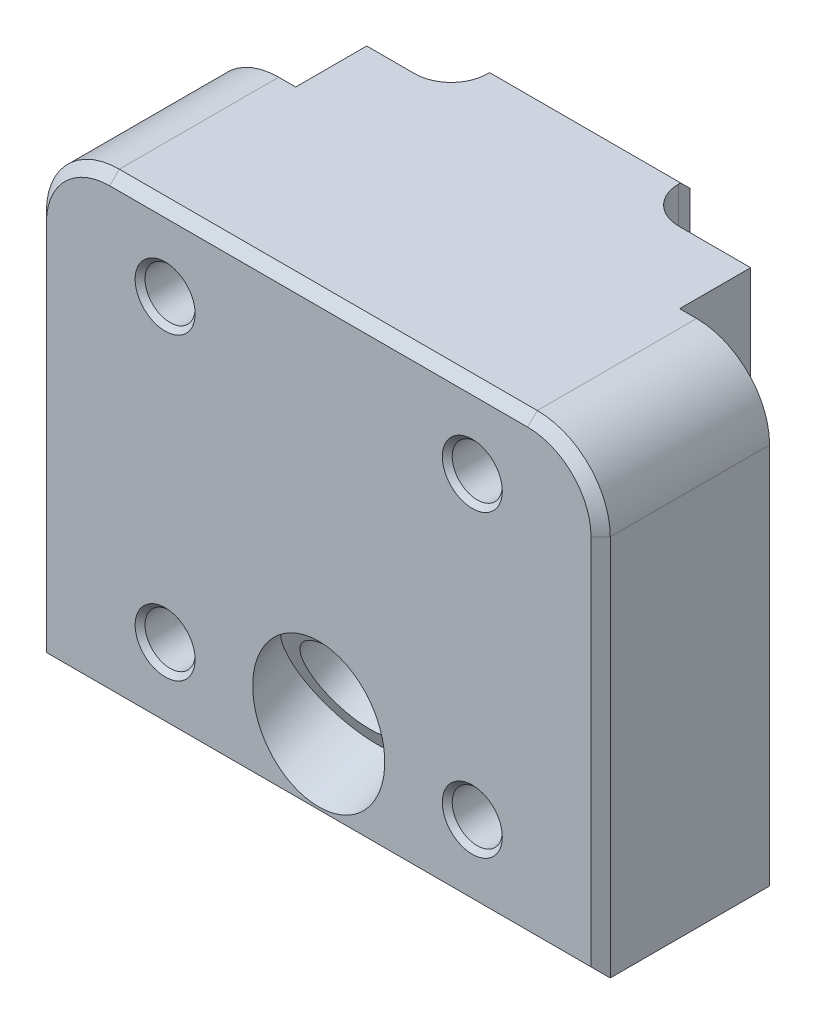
ISO-10303-21;
HEADER;
FILE_DESCRIPTION(('STEP AP214'),'2;1');
FILE_NAME('part.step','',(''),(''),'','','');
FILE_SCHEMA(('AUTOMOTIVE_DESIGN { 1 0 10303 214 1 1 1 1 }'));
ENDSEC;
DATA;
#1=APPLICATION_CONTEXT('core data for automotive mechanical design processes');
#2=APPLICATION_PROTOCOL_DEFINITION('international standard','automotive_design',2000,#1);
#3=PRODUCT_CONTEXT('',#1,'mechanical');
#4=PRODUCT('Part','Part','',(#3));
#5=PRODUCT_RELATED_PRODUCT_CATEGORY('part','',(#4));
#6=PRODUCT_DEFINITION_FORMATION('','',#4);
#7=PRODUCT_DEFINITION_CONTEXT('part definition',#1,'design');
#8=PRODUCT_DEFINITION('design','',#6,#7);
#9=PRODUCT_DEFINITION_SHAPE('','',#8);
#10=(LENGTH_UNIT() NAMED_UNIT(*) SI_UNIT(.MILLI.,.METRE.));
#11=(NAMED_UNIT(*) PLANE_ANGLE_UNIT() SI_UNIT($,.RADIAN.));
#12=(NAMED_UNIT(*) SI_UNIT($,.STERADIAN.) SOLID_ANGLE_UNIT());
#13=UNCERTAINTY_MEASURE_WITH_UNIT(LENGTH_MEASURE(1.E-05),#10,'distance_accuracy_value','');
#14=(GEOMETRIC_REPRESENTATION_CONTEXT(3) GLOBAL_UNCERTAINTY_ASSIGNED_CONTEXT((#13)) GLOBAL_UNIT_ASSIGNED_CONTEXT((#10,
#11,#12)) REPRESENTATION_CONTEXT('',''));
#15=CARTESIAN_POINT('',(0.,0.,0.));
#16=DIRECTION('',(0.,0.,1.));
#17=DIRECTION('',(1.,0.,0.));
#18=AXIS2_PLACEMENT_3D('',#15,#16,#17);
#19=CARTESIAN_POINT('',(0.,60.198,22.352));
#20=DIRECTION('',(0.,0.,-1.));
#21=DIRECTION('',(-1.,0.,0.));
#22=AXIS2_PLACEMENT_3D('',#19,#20,#21);
#23=PLANE('',#22);
#24=DIRECTION('',(0.999999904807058,-0.00043633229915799,0.));
#25=VECTOR('',#24,1.);
#26=CARTESIAN_POINT('',(-16.351250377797,49.9092683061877,22.352));
#27=LINE('',#26,#25);
#28=CARTESIAN_POINT('',(-16.3509963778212,49.9092681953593,22.352));
#29=VERTEX_POINT('',#28);
#30=CARTESIAN_POINT('',(-16.351250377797,49.9092683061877,22.352));
#31=VERTEX_POINT('',#30);
#32=EDGE_CURVE('E1558',#29,#31,#27,.F.);
#33=ORIENTED_EDGE('',*,*,#32,.F.);
#34=CARTESIAN_POINT('',(-20.32,49.911,22.352));
#35=DIRECTION('',(0.,0.,1.));
#36=DIRECTION('',(1.,0.,0.));
#37=AXIS2_PLACEMENT_3D('',#34,#35,#36);
#38=CIRCLE('',#37,3.969004);
#39=CARTESIAN_POINT('',(-16.350996,49.911,22.352));
#40=VERTEX_POINT('',#39);
#41=EDGE_CURVE('E1537',#40,#29,#38,.T.);
#42=ORIENTED_EDGE('',*,*,#41,.F.);
#43=DIRECTION('',(1.,0.,0.));
#44=VECTOR('',#43,1.);
#45=CARTESIAN_POINT('',(-16.35125,49.911,22.352));
#46=LINE('',#45,#44);
#47=CARTESIAN_POINT('',(-16.35125,49.911,22.352));
#48=VERTEX_POINT('',#47);
#49=EDGE_CURVE('E1554',#40,#48,#46,.F.);
#50=ORIENTED_EDGE('',*,*,#49,.T.);
#51=CARTESIAN_POINT('',(-20.32,49.911,22.352));
#52=DIRECTION('',(0.,0.,-1.));
#53=DIRECTION('',(-1.,0.,0.));
#54=AXIS2_PLACEMENT_3D('',#51,#52,#53);
#55=CIRCLE('',#54,3.96875);
#56=EDGE_CURVE('E553',#48,#31,#55,.T.);
#57=ORIENTED_EDGE('',*,*,#56,.T.);
#58=EDGE_LOOP('',(#33,#42,#50,#57));
#59=FACE_BOUND('',#58,.T.);
#60=DIRECTION('',(0.999999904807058,-0.00043633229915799,0.));
#61=VECTOR('',#60,1.);
#62=CARTESIAN_POINT('',(-16.351250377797,10.2852683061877,22.352));
#63=LINE('',#62,#61);
#64=CARTESIAN_POINT('',(-16.3509963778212,10.2852681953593,22.352));
#65=VERTEX_POINT('',#64);
#66=CARTESIAN_POINT('',(-16.351250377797,10.2852683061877,22.352));
#67=VERTEX_POINT('',#66);
#68=EDGE_CURVE('E568',#65,#67,#63,.F.);
#69=ORIENTED_EDGE('',*,*,#68,.F.);
#70=CARTESIAN_POINT('',(-20.32,10.287,22.352));
#71=DIRECTION('',(0.,0.,1.));
#72=DIRECTION('',(1.,0.,0.));
#73=AXIS2_PLACEMENT_3D('',#70,#71,#72);
#74=CIRCLE('',#73,3.969004);
#75=CARTESIAN_POINT('',(-16.350996,10.287,22.352));
#76=VERTEX_POINT('',#75);
#77=EDGE_CURVE('E1718',#76,#65,#74,.T.);
#78=ORIENTED_EDGE('',*,*,#77,.F.);
#79=DIRECTION('',(1.,0.,0.));
#80=VECTOR('',#79,1.);
#81=CARTESIAN_POINT('',(-16.35125,10.287,22.352));
#82=LINE('',#81,#80);
#83=CARTESIAN_POINT('',(-16.35125,10.287,22.352));
#84=VERTEX_POINT('',#83);
#85=EDGE_CURVE('E572',#76,#84,#82,.F.);
#86=ORIENTED_EDGE('',*,*,#85,.T.);
#87=CARTESIAN_POINT('',(-20.32,10.287,22.352));
#88=DIRECTION('',(0.,0.,-1.));
#89=DIRECTION('',(-1.,0.,0.));
#90=AXIS2_PLACEMENT_3D('',#87,#88,#89);
#91=CIRCLE('',#90,3.96875);
#92=EDGE_CURVE('E541',#84,#67,#91,.T.);
#93=ORIENTED_EDGE('',*,*,#92,.T.);
#94=EDGE_LOOP('',(#69,#78,#86,#93));
#95=FACE_BOUND('',#94,.T.);
#96=DIRECTION('',(1.,0.,0.));
#97=VECTOR('',#96,1.);
#98=CARTESIAN_POINT('',(37.2999,1.27,22.352));
#99=LINE('',#98,#97);
#100=CARTESIAN_POINT('',(-36.0299,1.27,22.352));
#101=VERTEX_POINT('',#100);
#102=CARTESIAN_POINT('',(36.0299,1.27,22.352));
#103=VERTEX_POINT('',#102);
#104=EDGE_CURVE('E488',#101,#103,#99,.T.);
#105=ORIENTED_EDGE('',*,*,#104,.T.);
#106=DIRECTION('',(0.,1.,0.));
#107=VECTOR('',#106,1.);
#108=CARTESIAN_POINT('',(36.0299,60.198,22.352));
#109=LINE('',#108,#107);
#110=CARTESIAN_POINT('',(36.0299,50.546,22.352));
#111=VERTEX_POINT('',#110);
#112=EDGE_CURVE('E505',#103,#111,#109,.T.);
#113=ORIENTED_EDGE('',*,*,#112,.T.);
#114=CARTESIAN_POINT('',(27.6479,50.546,22.352));
#115=DIRECTION('',(0.,0.,-1.));
#116=DIRECTION('',(-1.,0.,0.));
#117=AXIS2_PLACEMENT_3D('',#114,#115,#116);
#118=CIRCLE('',#117,8.382);
#119=CARTESIAN_POINT('',(27.6479,58.928,22.352));
#120=VERTEX_POINT('',#119);
#121=EDGE_CURVE('E503',#111,#120,#118,.F.);
#122=ORIENTED_EDGE('',*,*,#121,.T.);
#123=DIRECTION('',(-1.,0.,0.));
#124=VECTOR('',#123,1.);
#125=CARTESIAN_POINT('',(0.,58.928,22.352));
#126=LINE('',#125,#124);
#127=CARTESIAN_POINT('',(-27.6479,58.928,22.352));
#128=VERTEX_POINT('',#127);
#129=EDGE_CURVE('E501',#120,#128,#126,.T.);
#130=ORIENTED_EDGE('',*,*,#129,.T.);
#131=CARTESIAN_POINT('',(-27.6479,50.546,22.352));
#132=DIRECTION('',(0.,0.,-1.));
#133=DIRECTION('',(-1.,0.,0.));
#134=AXIS2_PLACEMENT_3D('',#131,#132,#133);
#135=CIRCLE('',#134,8.382);
#136=CARTESIAN_POINT('',(-36.0299,50.546,22.352));
#137=VERTEX_POINT('',#136);
#138=EDGE_CURVE('E499',#128,#137,#135,.F.);
#139=ORIENTED_EDGE('',*,*,#138,.T.);
#140=DIRECTION('',(0.,-1.,0.));
#141=VECTOR('',#140,1.);
#142=CARTESIAN_POINT('',(-36.0299,0.,22.352));
#143=LINE('',#142,#141);
#144=EDGE_CURVE('E497',#137,#101,#143,.T.);
#145=ORIENTED_EDGE('',*,*,#144,.T.);
#146=EDGE_LOOP('',(#105,#113,#122,#130,#139,#145));
#147=FACE_BOUND('',#146,.T.);
#148=CARTESIAN_POINT('',(0.,11.0867451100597,22.352));
#149=DIRECTION('',(0.,0.,-1.));
#150=DIRECTION('',(0.,1.,0.));
#151=AXIS2_PLACEMENT_3D('',#148,#149,#150);
#152=ELLIPSE('',#151,9.49218243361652,8.7376);
#153=CARTESIAN_POINT('',(0.,20.5789275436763,22.352));
#154=VERTEX_POINT('',#153);
#155=EDGE_CURVE('E476',#154,#154,#152,.F.);
#156=ORIENTED_EDGE('',*,*,#155,.F.);
#157=EDGE_LOOP('',(#156));
#158=FACE_BOUND('',#157,.T.);
#159=DIRECTION('',(0.999999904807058,-0.000436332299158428,0.));
#160=VECTOR('',#159,1.);
#161=CARTESIAN_POINT('',(24.288749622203,10.2852683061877,22.352));
#162=LINE('',#161,#160);
#163=CARTESIAN_POINT('',(24.2890036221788,10.2852681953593,22.352));
#164=VERTEX_POINT('',#163);
#165=CARTESIAN_POINT('',(24.288749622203,10.2852683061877,22.352));
#166=VERTEX_POINT('',#165);
#167=EDGE_CURVE('E1525',#164,#166,#162,.F.);
#168=ORIENTED_EDGE('',*,*,#167,.F.);
#169=CARTESIAN_POINT('',(20.32,10.287,22.352));
#170=DIRECTION('',(0.,0.,1.));
#171=DIRECTION('',(1.,0.,0.));
#172=AXIS2_PLACEMENT_3D('',#169,#170,#171);
#173=CIRCLE('',#172,3.969004);
#174=CARTESIAN_POINT('',(24.289004,10.287,22.352));
#175=VERTEX_POINT('',#174);
#176=EDGE_CURVE('E1571',#175,#164,#173,.T.);
#177=ORIENTED_EDGE('',*,*,#176,.F.);
#178=DIRECTION('',(1.,0.,0.));
#179=VECTOR('',#178,1.);
#180=CARTESIAN_POINT('',(24.28875,10.287,22.352));
#181=LINE('',#180,#179);
#182=CARTESIAN_POINT('',(24.28875,10.287,22.352));
#183=VERTEX_POINT('',#182);
#184=EDGE_CURVE('E1613',#175,#183,#181,.F.);
#185=ORIENTED_EDGE('',*,*,#184,.T.);
#186=CARTESIAN_POINT('',(20.32,10.287,22.352));
#187=DIRECTION('',(0.,0.,-1.));
#188=DIRECTION('',(-1.,0.,0.));
#189=AXIS2_PLACEMENT_3D('',#186,#187,#188);
#190=CIRCLE('',#189,3.96875);
#191=EDGE_CURVE('E546',#183,#166,#190,.T.);
#192=ORIENTED_EDGE('',*,*,#191,.T.);
#193=EDGE_LOOP('',(#168,#177,#185,#192));
#194=FACE_BOUND('',#193,.T.);
#195=DIRECTION('',(0.999999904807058,-0.00043633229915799,0.));
#196=VECTOR('',#195,1.);
#197=CARTESIAN_POINT('',(24.288749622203,49.9092683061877,22.352));
#198=LINE('',#197,#196);
#199=CARTESIAN_POINT('',(24.2890036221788,49.9092681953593,22.352));
#200=VERTEX_POINT('',#199);
#201=CARTESIAN_POINT('',(24.288749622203,49.9092683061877,22.352));
#202=VERTEX_POINT('',#201);
#203=EDGE_CURVE('E434',#200,#202,#198,.F.);
#204=ORIENTED_EDGE('',*,*,#203,.F.);
#205=CARTESIAN_POINT('',(20.32,49.911,22.352));
#206=DIRECTION('',(0.,0.,1.));
#207=DIRECTION('',(1.,0.,0.));
#208=AXIS2_PLACEMENT_3D('',#205,#206,#207);
#209=CIRCLE('',#208,3.969004);
#210=CARTESIAN_POINT('',(24.289004,49.911,22.352));
#211=VERTEX_POINT('',#210);
#212=EDGE_CURVE('E384',#211,#200,#209,.T.);
#213=ORIENTED_EDGE('',*,*,#212,.F.);
#214=DIRECTION('',(1.,0.,0.));
#215=VECTOR('',#214,1.);
#216=CARTESIAN_POINT('',(24.28875,49.911,22.352));
#217=LINE('',#216,#215);
#218=CARTESIAN_POINT('',(24.28875,49.911,22.352));
#219=VERTEX_POINT('',#218);
#220=EDGE_CURVE('E425',#211,#219,#217,.F.);
#221=ORIENTED_EDGE('',*,*,#220,.T.);
#222=CARTESIAN_POINT('',(20.32,49.911,22.352));
#223=DIRECTION('',(0.,0.,-1.));
#224=DIRECTION('',(-1.,0.,0.));
#225=AXIS2_PLACEMENT_3D('',#222,#223,#224);
#226=CIRCLE('',#225,3.96875);
#227=EDGE_CURVE('E1531',#219,#202,#226,.T.);
#228=ORIENTED_EDGE('',*,*,#227,.T.);
#229=EDGE_LOOP('',(#204,#213,#221,#228));
#230=FACE_BOUND('',#229,.T.);
#231=ADVANCED_FACE('F17',(#59,#95,#147,#158,#194,#230),#23,.F.);
#232=CARTESIAN_POINT('',(-25.4,60.198,0.));
#233=DIRECTION('',(-1.,0.,0.));
#234=DIRECTION('',(0.,0.,1.));
#235=AXIS2_PLACEMENT_3D('',#232,#233,#234);
#236=PLANE('',#235);
#237=DIRECTION('',(0.,1.,0.));
#238=VECTOR('',#237,1.);
#239=CARTESIAN_POINT('',(-25.4,60.198,-9.398));
#240=LINE('',#239,#238);
#241=CARTESIAN_POINT('',(-25.4,38.620648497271,-9.398));
#242=VERTEX_POINT('',#241);
#243=CARTESIAN_POINT('',(-25.4,60.198,-9.398));
#244=VERTEX_POINT('',#243);
#245=EDGE_CURVE('E340',#242,#244,#240,.T.);
#246=ORIENTED_EDGE('',*,*,#245,.F.);
#247=DIRECTION('',(0.,0.438371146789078,-0.898794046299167));
#248=VECTOR('',#247,1.);
#249=CARTESIAN_POINT('',(-25.4,39.0642896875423,-10.307599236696));
#250=LINE('',#249,#248);
#251=CARTESIAN_POINT('',(-25.4,34.7327063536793,-1.4265372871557));
#252=VERTEX_POINT('',#251);
#253=EDGE_CURVE('E451',#252,#242,#250,.T.);
#254=ORIENTED_EDGE('',*,*,#253,.F.);
#255=CARTESIAN_POINT('',(-25.4,32.4497694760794,-2.53999999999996));
#256=DIRECTION('',(-1.,0.,0.));
#257=DIRECTION('',(0.,0.,1.));
#258=AXIS2_PLACEMENT_3D('',#255,#256,#257);
#259=CIRCLE('',#258,2.54);
#260=CARTESIAN_POINT('',(-25.4,32.4497694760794,0.));
#261=VERTEX_POINT('',#260);
#262=EDGE_CURVE('E534',#252,#261,#259,.F.);
#263=ORIENTED_EDGE('',*,*,#262,.T.);
#264=DIRECTION('',(0.,-1.,0.));
#265=VECTOR('',#264,1.);
#266=CARTESIAN_POINT('',(-25.4,60.198,0.));
#267=LINE('',#266,#265);
#268=CARTESIAN_POINT('',(-25.4,60.198,0.));
#269=VERTEX_POINT('',#268);
#270=EDGE_CURVE('E457',#269,#261,#267,.T.);
#271=ORIENTED_EDGE('',*,*,#270,.F.);
#272=DIRECTION('',(0.,0.,1.));
#273=VECTOR('',#272,1.);
#274=CARTESIAN_POINT('',(-25.4,60.198,0.));
#275=LINE('',#274,#273);
#276=EDGE_CURVE('E456',#244,#269,#275,.T.);
#277=ORIENTED_EDGE('',*,*,#276,.F.);
#278=EDGE_LOOP('',(#246,#254,#263,#271,#277));
#279=FACE_BOUND('',#278,.T.);
#280=ADVANCED_FACE('F453',(#279),#236,.T.);
#281=CARTESIAN_POINT('',(25.4,60.198,0.));
#282=DIRECTION('',(-1.,0.,0.));
#283=DIRECTION('',(0.,0.,1.));
#284=AXIS2_PLACEMENT_3D('',#281,#282,#283);
#285=PLANE('',#284);
#286=DIRECTION('',(0.,0.438371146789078,-0.898794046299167));
#287=VECTOR('',#286,1.);
#288=CARTESIAN_POINT('',(25.4,39.0642896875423,-10.307599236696));
#289=LINE('',#288,#287);
#290=CARTESIAN_POINT('',(25.4,34.7327063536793,-1.42653728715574));
#291=VERTEX_POINT('',#290);
#292=CARTESIAN_POINT('',(25.4,38.620648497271,-9.398));
#293=VERTEX_POINT('',#292);
#294=EDGE_CURVE('E615',#291,#293,#289,.T.);
#295=ORIENTED_EDGE('',*,*,#294,.T.);
#296=DIRECTION('',(0.,1.,0.));
#297=VECTOR('',#296,1.);
#298=CARTESIAN_POINT('',(25.4,60.198,-9.398));
#299=LINE('',#298,#297);
#300=CARTESIAN_POINT('',(25.4,60.198,-9.398));
#301=VERTEX_POINT('',#300);
#302=EDGE_CURVE('E375',#293,#301,#299,.T.);
#303=ORIENTED_EDGE('',*,*,#302,.T.);
#304=DIRECTION('',(0.,0.,1.));
#305=VECTOR('',#304,1.);
#306=CARTESIAN_POINT('',(25.4,60.198,0.));
#307=LINE('',#306,#305);
#308=CARTESIAN_POINT('',(25.4,60.198,0.));
#309=VERTEX_POINT('',#308);
#310=EDGE_CURVE('E460',#301,#309,#307,.T.);
#311=ORIENTED_EDGE('',*,*,#310,.T.);
#312=DIRECTION('',(0.,-1.,0.));
#313=VECTOR('',#312,1.);
#314=CARTESIAN_POINT('',(25.4,60.198,0.));
#315=LINE('',#314,#313);
#316=CARTESIAN_POINT('',(25.4,32.4497694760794,0.));
#317=VERTEX_POINT('',#316);
#318=EDGE_CURVE('E627',#309,#317,#315,.T.);
#319=ORIENTED_EDGE('',*,*,#318,.T.);
#320=CARTESIAN_POINT('',(25.4,32.4497694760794,-2.54));
#321=DIRECTION('',(-1.,0.,0.));
#322=DIRECTION('',(0.,0.,1.));
#323=AXIS2_PLACEMENT_3D('',#320,#321,#322);
#324=CIRCLE('',#323,2.54);
#325=EDGE_CURVE('E536',#317,#291,#324,.T.);
#326=ORIENTED_EDGE('',*,*,#325,.T.);
#327=EDGE_LOOP('',(#295,#303,#311,#319,#326));
#328=FACE_BOUND('',#327,.T.);
#329=ADVANCED_FACE('F708',(#328),#285,.F.);
#330=CARTESIAN_POINT('',(25.4,60.198,-15.748));
#331=DIRECTION('',(0.,0.,1.));
#332=DIRECTION('',(1.,0.,0.));
#333=AXIS2_PLACEMENT_3D('',#330,#331,#332);
#334=PLANE('',#333);
#335=DIRECTION('',(-1.,0.,0.));
#336=VECTOR('',#335,1.);
#337=CARTESIAN_POINT('',(25.4,42.3654504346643,-15.748));
#338=LINE('',#337,#336);
#339=CARTESIAN_POINT('',(11.049,42.3654504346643,-15.748));
#340=VERTEX_POINT('',#339);
#341=CARTESIAN_POINT('',(-14.224,42.3654504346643,-15.748));
#342=VERTEX_POINT('',#341);
#343=EDGE_CURVE('E525',#340,#342,#338,.T.);
#344=ORIENTED_EDGE('',*,*,#343,.T.);
#345=DIRECTION('',(0.,1.,0.));
#346=VECTOR('',#345,1.);
#347=CARTESIAN_POINT('',(-14.224,60.198,-15.748));
#348=LINE('',#347,#346);
#349=CARTESIAN_POINT('',(-14.224,58.928,-15.748));
#350=VERTEX_POINT('',#349);
#351=EDGE_CURVE('E32',#342,#350,#348,.T.);
#352=ORIENTED_EDGE('',*,*,#351,.T.);
#353=DIRECTION('',(1.,0.,0.));
#354=VECTOR('',#353,1.);
#355=CARTESIAN_POINT('',(25.4,58.928,-15.748));
#356=LINE('',#355,#354);
#357=CARTESIAN_POINT('',(11.049,58.928,-15.748));
#358=VERTEX_POINT('',#357);
#359=EDGE_CURVE('E523',#350,#358,#356,.T.);
#360=ORIENTED_EDGE('',*,*,#359,.T.);
#361=DIRECTION('',(0.,-1.,0.));
#362=VECTOR('',#361,1.);
#363=CARTESIAN_POINT('',(11.049,60.198,-15.748));
#364=LINE('',#363,#362);
#365=EDGE_CURVE('E370',#358,#340,#364,.T.);
#366=ORIENTED_EDGE('',*,*,#365,.T.);
#367=EDGE_LOOP('',(#344,#352,#360,#366));
#368=FACE_BOUND('',#367,.T.);
#369=ADVANCED_FACE('F721',(#368),#334,.F.);
#370=CARTESIAN_POINT('',(-37.2999,60.198,22.352));
#371=DIRECTION('',(0.,-1.,0.));
#372=DIRECTION('',(0.,0.,-1.));
#373=AXIS2_PLACEMENT_3D('',#370,#371,#372);
#374=PLANE('',#373);
#375=DIRECTION('',(-1.,0.,0.));
#376=VECTOR('',#375,1.);
#377=CARTESIAN_POINT('',(-37.2999,60.198,-14.478));
#378=LINE('',#377,#376);
#379=CARTESIAN_POINT('',(11.049,60.198,-14.478));
#380=VERTEX_POINT('',#379);
#381=CARTESIAN_POINT('',(-14.224,60.198,-14.478));
#382=VERTEX_POINT('',#381);
#383=EDGE_CURVE('E521',#380,#382,#378,.T.);
#384=ORIENTED_EDGE('',*,*,#383,.T.);
#385=DIRECTION('',(0.,0.,-1.));
#386=VECTOR('',#385,1.);
#387=CARTESIAN_POINT('',(-14.224,60.198,-20.4463576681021));
#388=LINE('',#387,#386);
#389=CARTESIAN_POINT('',(-14.224,60.198,-14.224));
#390=VERTEX_POINT('',#389);
#391=EDGE_CURVE('E334',#390,#382,#388,.T.);
#392=ORIENTED_EDGE('',*,*,#391,.F.);
#393=CARTESIAN_POINT('',(-19.05,60.198,-14.224));
#394=DIRECTION('',(0.,1.,0.));
#395=DIRECTION('',(0.,0.,-1.));
#396=AXIS2_PLACEMENT_3D('',#393,#394,#395);
#397=CIRCLE('',#396,4.826);
#398=CARTESIAN_POINT('',(-19.05,60.198,-9.398));
#399=VERTEX_POINT('',#398);
#400=EDGE_CURVE('E329',#399,#390,#397,.T.);
#401=ORIENTED_EDGE('',*,*,#400,.F.);
#402=DIRECTION('',(1.,0.,0.));
#403=VECTOR('',#402,1.);
#404=CARTESIAN_POINT('',(-19.05,60.198,-9.398));
#405=LINE('',#404,#403);
#406=EDGE_CURVE('E337',#244,#399,#405,.T.);
#407=ORIENTED_EDGE('',*,*,#406,.F.);
#408=ORIENTED_EDGE('',*,*,#276,.T.);
#409=DIRECTION('',(-1.,0.,0.));
#410=VECTOR('',#409,1.);
#411=CARTESIAN_POINT('',(37.2999,60.198,0.));
#412=LINE('',#411,#410);
#413=CARTESIAN_POINT('',(-27.6479,60.198,0.));
#414=VERTEX_POINT('',#413);
#415=EDGE_CURVE('E621',#269,#414,#412,.T.);
#416=ORIENTED_EDGE('',*,*,#415,.T.);
#417=DIRECTION('',(0.,0.,-1.));
#418=VECTOR('',#417,1.);
#419=CARTESIAN_POINT('',(-27.6479,60.198,22.352));
#420=LINE('',#419,#418);
#421=CARTESIAN_POINT('',(-27.6479,60.198,21.082));
#422=VERTEX_POINT('',#421);
#423=EDGE_CURVE('E489',#414,#422,#420,.F.);
#424=ORIENTED_EDGE('',*,*,#423,.T.);
#425=DIRECTION('',(1.,0.,0.));
#426=VECTOR('',#425,1.);
#427=CARTESIAN_POINT('',(-37.2999,60.198,21.082));
#428=LINE('',#427,#426);
#429=CARTESIAN_POINT('',(27.6479,60.198,21.082));
#430=VERTEX_POINT('',#429);
#431=EDGE_CURVE('E513',#422,#430,#428,.T.);
#432=ORIENTED_EDGE('',*,*,#431,.T.);
#433=DIRECTION('',(0.,0.,-1.));
#434=VECTOR('',#433,1.);
#435=CARTESIAN_POINT('',(27.6479,60.198,22.352));
#436=LINE('',#435,#434);
#437=CARTESIAN_POINT('',(27.6479,60.198,0.));
#438=VERTEX_POINT('',#437);
#439=EDGE_CURVE('E492',#430,#438,#436,.T.);
#440=ORIENTED_EDGE('',*,*,#439,.T.);
#441=EDGE_CURVE('E483',#438,#309,#412,.T.);
#442=ORIENTED_EDGE('',*,*,#441,.T.);
#443=ORIENTED_EDGE('',*,*,#310,.F.);
#444=DIRECTION('',(1.,0.,0.));
#445=VECTOR('',#444,1.);
#446=CARTESIAN_POINT('',(15.875,60.198,-9.398));
#447=LINE('',#446,#445);
#448=CARTESIAN_POINT('',(15.875,60.198,-9.398));
#449=VERTEX_POINT('',#448);
#450=EDGE_CURVE('E359',#449,#301,#447,.T.);
#451=ORIENTED_EDGE('',*,*,#450,.F.);
#452=CARTESIAN_POINT('',(15.875,60.198,-14.224));
#453=DIRECTION('',(0.,1.,0.));
#454=DIRECTION('',(0.,0.,-1.));
#455=AXIS2_PLACEMENT_3D('',#452,#453,#454);
#456=CIRCLE('',#455,4.826);
#457=CARTESIAN_POINT('',(11.049,60.198,-14.224));
#458=VERTEX_POINT('',#457);
#459=EDGE_CURVE('E356',#458,#449,#456,.T.);
#460=ORIENTED_EDGE('',*,*,#459,.F.);
#461=DIRECTION('',(0.,0.,1.));
#462=VECTOR('',#461,1.);
#463=CARTESIAN_POINT('',(11.049,60.198,-14.224));
#464=LINE('',#463,#462);
#465=EDGE_CURVE('E361',#380,#458,#464,.T.);
#466=ORIENTED_EDGE('',*,*,#465,.F.);
#467=EDGE_LOOP('',(#384,#392,#401,#407,#408,#416,#424,#432,#440,#442,#443,#451,#460,#466));
#468=FACE_BOUND('',#467,.T.);
#469=ADVANCED_FACE('F345',(#468),#374,.F.);
#470=CARTESIAN_POINT('',(-37.2999,0.,22.352));
#471=DIRECTION('',(0.,-1.,0.));
#472=DIRECTION('',(0.,0.,-1.));
#473=AXIS2_PLACEMENT_3D('',#470,#471,#472);
#474=PLANE('',#473);
#475=DIRECTION('',(0.,0.,-1.));
#476=VECTOR('',#475,1.);
#477=CARTESIAN_POINT('',(37.2999,0.,22.352));
#478=LINE('',#477,#476);
#479=CARTESIAN_POINT('',(37.2999,0.,21.082));
#480=VERTEX_POINT('',#479);
#481=CARTESIAN_POINT('',(37.2999,0.,0.));
#482=VERTEX_POINT('',#481);
#483=EDGE_CURVE('E481',#480,#482,#478,.T.);
#484=ORIENTED_EDGE('',*,*,#483,.F.);
#485=DIRECTION('',(-1.,0.,0.));
#486=VECTOR('',#485,1.);
#487=CARTESIAN_POINT('',(-37.2999,0.,21.082));
#488=LINE('',#487,#486);
#489=CARTESIAN_POINT('',(-37.2999,0.,21.082));
#490=VERTEX_POINT('',#489);
#491=EDGE_CURVE('E519',#480,#490,#488,.T.);
#492=ORIENTED_EDGE('',*,*,#491,.T.);
#493=DIRECTION('',(0.,0.,-1.));
#494=VECTOR('',#493,1.);
#495=CARTESIAN_POINT('',(-37.2999,0.,22.352));
#496=LINE('',#495,#494);
#497=CARTESIAN_POINT('',(-37.2999,0.,0.));
#498=VERTEX_POINT('',#497);
#499=EDGE_CURVE('E485',#490,#498,#496,.T.);
#500=ORIENTED_EDGE('',*,*,#499,.T.);
#501=DIRECTION('',(-1.,0.,0.));
#502=VECTOR('',#501,1.);
#503=CARTESIAN_POINT('',(37.2999,0.,0.));
#504=LINE('',#503,#502);
#505=EDGE_CURVE('E484',#482,#498,#504,.T.);
#506=ORIENTED_EDGE('',*,*,#505,.F.);
#507=EDGE_LOOP('',(#484,#492,#500,#506));
#508=FACE_BOUND('',#507,.T.);
#509=ADVANCED_FACE('F665',(#508),#474,.T.);
#510=CARTESIAN_POINT('',(-37.2999,60.198,22.352));
#511=DIRECTION('',(-1.,0.,0.));
#512=DIRECTION('',(0.,0.,1.));
#513=AXIS2_PLACEMENT_3D('',#510,#511,#512);
#514=PLANE('',#513);
#515=ORIENTED_EDGE('',*,*,#499,.F.);
#516=DIRECTION('',(0.,1.,0.));
#517=VECTOR('',#516,1.);
#518=CARTESIAN_POINT('',(-37.2999,50.546,21.082));
#519=LINE('',#518,#517);
#520=CARTESIAN_POINT('',(-37.2999,50.546,21.082));
#521=VERTEX_POINT('',#520);
#522=EDGE_CURVE('E517',#490,#521,#519,.T.);
#523=ORIENTED_EDGE('',*,*,#522,.T.);
#524=DIRECTION('',(0.,0.,-1.));
#525=VECTOR('',#524,1.);
#526=CARTESIAN_POINT('',(-37.2999,50.546,0.));
#527=LINE('',#526,#525);
#528=CARTESIAN_POINT('',(-37.2999,50.546,0.));
#529=VERTEX_POINT('',#528);
#530=EDGE_CURVE('E480',#521,#529,#527,.T.);
#531=ORIENTED_EDGE('',*,*,#530,.T.);
#532=DIRECTION('',(0.,-1.,0.));
#533=VECTOR('',#532,1.);
#534=CARTESIAN_POINT('',(-37.2999,60.198,0.));
#535=LINE('',#534,#533);
#536=EDGE_CURVE('E493',#529,#498,#535,.T.);
#537=ORIENTED_EDGE('',*,*,#536,.T.);
#538=EDGE_LOOP('',(#515,#523,#531,#537));
#539=FACE_BOUND('',#538,.T.);
#540=ADVANCED_FACE('F668',(#539),#514,.T.);
#541=CARTESIAN_POINT('',(37.2999,60.198,0.));
#542=DIRECTION('',(0.,0.,1.));
#543=DIRECTION('',(1.,0.,0.));
#544=AXIS2_PLACEMENT_3D('',#541,#542,#543);
#545=PLANE('',#544);
#546=ORIENTED_EDGE('',*,*,#270,.T.);
#547=DIRECTION('',(-1.,0.,0.));
#548=VECTOR('',#547,1.);
#549=CARTESIAN_POINT('',(25.4,32.4497694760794,0.));
#550=LINE('',#549,#548);
#551=EDGE_CURVE('E531',#261,#317,#550,.F.);
#552=ORIENTED_EDGE('',*,*,#551,.T.);
#553=ORIENTED_EDGE('',*,*,#318,.F.);
#554=ORIENTED_EDGE('',*,*,#441,.F.);
#555=CARTESIAN_POINT('',(27.6479,50.546,0.));
#556=DIRECTION('',(0.,0.,1.));
#557=DIRECTION('',(1.,0.,0.));
#558=AXIS2_PLACEMENT_3D('',#555,#556,#557);
#559=CIRCLE('',#558,9.652);
#560=CARTESIAN_POINT('',(37.2999,50.546,0.));
#561=VERTEX_POINT('',#560);
#562=EDGE_CURVE('E468',#438,#561,#559,.F.);
#563=ORIENTED_EDGE('',*,*,#562,.T.);
#564=DIRECTION('',(0.,-1.,0.));
#565=VECTOR('',#564,1.);
#566=CARTESIAN_POINT('',(37.2999,60.198,0.));
#567=LINE('',#566,#565);
#568=EDGE_CURVE('E623',#561,#482,#567,.T.);
#569=ORIENTED_EDGE('',*,*,#568,.T.);
#570=ORIENTED_EDGE('',*,*,#505,.T.);
#571=ORIENTED_EDGE('',*,*,#536,.F.);
#572=CARTESIAN_POINT('',(-27.6479,50.546,0.));
#573=DIRECTION('',(0.,0.,1.));
#574=DIRECTION('',(1.,0.,0.));
#575=AXIS2_PLACEMENT_3D('',#572,#573,#574);
#576=CIRCLE('',#575,9.652);
#577=EDGE_CURVE('E495',#529,#414,#576,.F.);
#578=ORIENTED_EDGE('',*,*,#577,.T.);
#579=ORIENTED_EDGE('',*,*,#415,.F.);
#580=EDGE_LOOP('',(#546,#552,#553,#554,#563,#569,#570,#571,#578,#579));
#581=FACE_BOUND('',#580,.T.);
#582=CARTESIAN_POINT('',(0.,20.5746062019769,0.));
#583=DIRECTION('',(0.,0.,1.));
#584=DIRECTION('',(0.,-1.,0.));
#585=AXIS2_PLACEMENT_3D('',#582,#583,#584);
#586=ELLIPSE('',#585,6.90528678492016,6.35635);
#587=CARTESIAN_POINT('',(0.,13.6693194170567,0.));
#588=VERTEX_POINT('',#587);
#589=EDGE_CURVE('E463',#588,#588,#586,.T.);
#590=ORIENTED_EDGE('',*,*,#589,.T.);
#591=EDGE_LOOP('',(#590));
#592=FACE_BOUND('',#591,.T.);
#593=ADVANCED_FACE('F640',(#581,#592),#545,.F.);
#594=CARTESIAN_POINT('',(37.2999,60.198,22.352));
#595=DIRECTION('',(-1.,0.,0.));
#596=DIRECTION('',(0.,0.,1.));
#597=AXIS2_PLACEMENT_3D('',#594,#595,#596);
#598=PLANE('',#597);
#599=DIRECTION('',(0.,0.,-1.));
#600=VECTOR('',#599,1.);
#601=CARTESIAN_POINT('',(37.2999,50.546,22.352));
#602=LINE('',#601,#600);
#603=CARTESIAN_POINT('',(37.2999,50.546,21.082));
#604=VERTEX_POINT('',#603);
#605=EDGE_CURVE('E477',#561,#604,#602,.F.);
#606=ORIENTED_EDGE('',*,*,#605,.T.);
#607=DIRECTION('',(0.,-1.,0.));
#608=VECTOR('',#607,1.);
#609=CARTESIAN_POINT('',(37.2999,60.198,21.082));
#610=LINE('',#609,#608);
#611=EDGE_CURVE('E508',#604,#480,#610,.T.);
#612=ORIENTED_EDGE('',*,*,#611,.T.);
#613=ORIENTED_EDGE('',*,*,#483,.T.);
#614=ORIENTED_EDGE('',*,*,#568,.F.);
#615=EDGE_LOOP('',(#606,#612,#613,#614));
#616=FACE_BOUND('',#615,.T.);
#617=ADVANCED_FACE('F649',(#616),#598,.F.);
#618=CARTESIAN_POINT('',(191.641137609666,34.0369376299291,0.));
#619=DIRECTION('',(0.,0.898794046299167,0.438371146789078));
#620=DIRECTION('',(0.,-0.438371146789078,0.898794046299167));
#621=AXIS2_PLACEMENT_3D('',#618,#619,#620);
#622=PLANE('',#621);
#623=CARTESIAN_POINT('',(-19.05,40.9744459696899,-14.224));
#624=DIRECTION('',(0.,0.898794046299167,0.438371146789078));
#625=DIRECTION('',(0.,0.438371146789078,-0.898794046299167));
#626=AXIS2_PLACEMENT_3D('',#623,#624,#625);
#627=ELLIPSE('',#626,5.36941696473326,4.826);
#628=CARTESIAN_POINT('',(-19.05,38.620648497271,-9.398));
#629=VERTEX_POINT('',#628);
#630=CARTESIAN_POINT('',(-14.224,40.9744459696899,-14.224));
#631=VERTEX_POINT('',#630);
#632=EDGE_CURVE('E10',#629,#631,#627,.T.);
#633=ORIENTED_EDGE('',*,*,#632,.T.);
#634=DIRECTION('',(0.,0.438371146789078,-0.898794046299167));
#635=VECTOR('',#634,1.);
#636=CARTESIAN_POINT('',(-14.224,34.0369376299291,0.));
#637=LINE('',#636,#635);
#638=CARTESIAN_POINT('',(-14.224,41.101071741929,-14.4836213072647));
#639=VERTEX_POINT('',#638);
#640=EDGE_CURVE('E349',#631,#639,#637,.T.);
#641=ORIENTED_EDGE('',*,*,#640,.T.);
#642=DIRECTION('',(1.,0.,0.));
#643=VECTOR('',#642,1.);
#644=CARTESIAN_POINT('',(191.641137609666,41.101071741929,-14.4836213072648));
#645=LINE('',#644,#643);
#646=CARTESIAN_POINT('',(11.049,41.101071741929,-14.4836213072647));
#647=VERTEX_POINT('',#646);
#648=EDGE_CURVE('E40',#639,#647,#645,.T.);
#649=ORIENTED_EDGE('',*,*,#648,.T.);
#650=DIRECTION('',(0.,-0.438371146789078,0.898794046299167));
#651=VECTOR('',#650,1.);
#652=CARTESIAN_POINT('',(11.049,34.0369376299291,0.));
#653=LINE('',#652,#651);
#654=CARTESIAN_POINT('',(11.049,40.9744459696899,-14.224));
#655=VERTEX_POINT('',#654);
#656=EDGE_CURVE('E367',#647,#655,#653,.T.);
#657=ORIENTED_EDGE('',*,*,#656,.T.);
#658=CARTESIAN_POINT('',(15.875,40.9744459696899,-14.224));
#659=DIRECTION('',(0.,0.898794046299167,0.438371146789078));
#660=DIRECTION('',(0.,0.438371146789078,-0.898794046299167));
#661=AXIS2_PLACEMENT_3D('',#658,#659,#660);
#662=ELLIPSE('',#661,5.36941696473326,4.826);
#663=CARTESIAN_POINT('',(15.875,38.620648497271,-9.398));
#664=VERTEX_POINT('',#663);
#665=EDGE_CURVE('E443',#655,#664,#662,.T.);
#666=ORIENTED_EDGE('',*,*,#665,.T.);
#667=DIRECTION('',(1.,0.,0.));
#668=VECTOR('',#667,1.);
#669=CARTESIAN_POINT('',(191.641137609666,38.620648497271,-9.398));
#670=LINE('',#669,#668);
#671=EDGE_CURVE('E439',#664,#293,#670,.T.);
#672=ORIENTED_EDGE('',*,*,#671,.T.);
#673=ORIENTED_EDGE('',*,*,#294,.F.);
#674=DIRECTION('',(-1.,0.,0.));
#675=VECTOR('',#674,1.);
#676=CARTESIAN_POINT('',(-25.4,34.7327063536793,-1.4265372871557));
#677=LINE('',#676,#675);
#678=EDGE_CURVE('E529',#291,#252,#677,.T.);
#679=ORIENTED_EDGE('',*,*,#678,.T.);
#680=ORIENTED_EDGE('',*,*,#253,.T.);
#681=DIRECTION('',(1.,0.,0.));
#682=VECTOR('',#681,1.);
#683=CARTESIAN_POINT('',(191.641137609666,38.620648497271,-9.398));
#684=LINE('',#683,#682);
#685=EDGE_CURVE('E25',#242,#629,#684,.T.);
#686=ORIENTED_EDGE('',*,*,#685,.T.);
#687=EDGE_LOOP('',(#633,#641,#649,#657,#666,#672,#673,#679,#680,#686));
#688=FACE_BOUND('',#687,.T.);
#689=ADVANCED_FACE('F448',(#688),#622,.F.);
#690=CARTESIAN_POINT('',(0.,2.47865266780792,42.6313949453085));
#691=DIRECTION('',(0.,0.390731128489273,-0.92050485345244));
#692=DIRECTION('',(0.,0.92050485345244,0.390731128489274));
#693=AXIS2_PLACEMENT_3D('',#690,#691,#692);
#694=CYLINDRICAL_SURFACE('',#693,8.7376);
#695=CARTESIAN_POINT('',(0.,12.9223776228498,18.0275208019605));
#696=DIRECTION('',(0.,-0.390731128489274,0.920504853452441));
#697=DIRECTION('',(0.,-0.92050485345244,-0.390731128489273));
#698=AXIS2_PLACEMENT_3D('',#695,#696,#697);
#699=CIRCLE('',#698,8.7376);
#700=CARTESIAN_POINT('',(0.,4.87937441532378,14.6134684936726));
#701=VERTEX_POINT('',#700);
#702=EDGE_CURVE('E472',#701,#701,#699,.T.);
#703=ORIENTED_EDGE('',*,*,#702,.F.);
#704=EDGE_LOOP('',(#703));
#705=FACE_BOUND('',#704,.T.);
#706=ORIENTED_EDGE('',*,*,#155,.T.);
#707=EDGE_LOOP('',(#706));
#708=FACE_BOUND('',#707,.T.);
#709=ADVANCED_FACE('F735',(#705,#708),#694,.F.);
#710=CARTESIAN_POINT('',(0.,12.9223776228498,18.0275208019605));
#711=DIRECTION('',(0.,-0.390731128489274,0.920504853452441));
#712=DIRECTION('',(0.,-0.92050485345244,-0.390731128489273));
#713=AXIS2_PLACEMENT_3D('',#710,#711,#712);
#714=PLANE('',#713);
#715=CARTESIAN_POINT('',(0.,12.9223776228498,18.0275208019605));
#716=DIRECTION('',(0.,-0.390731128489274,0.920504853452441));
#717=DIRECTION('',(0.,-0.92050485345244,-0.390731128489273));
#718=AXIS2_PLACEMENT_3D('',#715,#716,#717);
#719=CIRCLE('',#718,6.35635);
#720=CARTESIAN_POINT('',(0.,7.0713265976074,15.5438969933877));
#721=VERTEX_POINT('',#720);
#722=EDGE_CURVE('E459',#721,#721,#719,.T.);
#723=ORIENTED_EDGE('',*,*,#722,.F.);
#724=EDGE_LOOP('',(#723));
#725=FACE_BOUND('',#724,.T.);
#726=ORIENTED_EDGE('',*,*,#702,.T.);
#727=EDGE_LOOP('',(#726));
#728=FACE_BOUND('',#727,.T.);
#729=ADVANCED_FACE('F731',(#725,#728),#714,.T.);
#730=CARTESIAN_POINT('',(0.,22.327793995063,-4.13025161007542));
#731=DIRECTION('',(0.,-0.390731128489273,0.92050485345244));
#732=DIRECTION('',(0.,-0.92050485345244,-0.390731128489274));
#733=AXIS2_PLACEMENT_3D('',#730,#731,#732);
#734=CYLINDRICAL_SURFACE('',#733,6.35635);
#735=ORIENTED_EDGE('',*,*,#722,.T.);
#736=EDGE_LOOP('',(#735));
#737=FACE_BOUND('',#736,.T.);
#738=ORIENTED_EDGE('',*,*,#589,.F.);
#739=EDGE_LOOP('',(#738));
#740=FACE_BOUND('',#739,.T.);
#741=ADVANCED_FACE('F728',(#737,#740),#734,.F.);
#742=CARTESIAN_POINT('',(27.6479,50.546,22.352));
#743=DIRECTION('',(0.,0.,-1.));
#744=DIRECTION('',(-1.,0.,0.));
#745=AXIS2_PLACEMENT_3D('',#742,#743,#744);
#746=CYLINDRICAL_SURFACE('',#745,9.652);
#747=ORIENTED_EDGE('',*,*,#439,.F.);
#748=CARTESIAN_POINT('',(27.6479,50.546,21.082));
#749=DIRECTION('',(0.,0.,-1.));
#750=DIRECTION('',(-1.,0.,0.));
#751=AXIS2_PLACEMENT_3D('',#748,#749,#750);
#752=CIRCLE('',#751,9.652);
#753=EDGE_CURVE('E511',#430,#604,#752,.T.);
#754=ORIENTED_EDGE('',*,*,#753,.T.);
#755=ORIENTED_EDGE('',*,*,#605,.F.);
#756=ORIENTED_EDGE('',*,*,#562,.F.);
#757=EDGE_LOOP('',(#747,#754,#755,#756));
#758=FACE_BOUND('',#757,.T.);
#759=ADVANCED_FACE('F652',(#758),#746,.T.);
#760=CARTESIAN_POINT('',(-27.6479,50.546,22.352));
#761=DIRECTION('',(0.,0.,1.));
#762=DIRECTION('',(1.,0.,0.));
#763=AXIS2_PLACEMENT_3D('',#760,#761,#762);
#764=CYLINDRICAL_SURFACE('',#763,9.652);
#765=ORIENTED_EDGE('',*,*,#530,.F.);
#766=CARTESIAN_POINT('',(-27.6479,50.546,21.082));
#767=DIRECTION('',(0.,0.,-1.));
#768=DIRECTION('',(-1.,0.,0.));
#769=AXIS2_PLACEMENT_3D('',#766,#767,#768);
#770=CIRCLE('',#769,9.652);
#771=EDGE_CURVE('E515',#521,#422,#770,.T.);
#772=ORIENTED_EDGE('',*,*,#771,.T.);
#773=ORIENTED_EDGE('',*,*,#423,.F.);
#774=ORIENTED_EDGE('',*,*,#577,.F.);
#775=EDGE_LOOP('',(#765,#772,#773,#774));
#776=FACE_BOUND('',#775,.T.);
#777=ADVANCED_FACE('F673',(#776),#764,.T.);
#778=CARTESIAN_POINT('',(20.32,49.911,5.1816));
#779=DIRECTION('',(0.,0.,1.));
#780=DIRECTION('',(1.,0.,0.));
#781=AXIS2_PLACEMENT_3D('',#778,#779,#780);
#782=CYLINDRICAL_SURFACE('',#781,3.3147);
#783=CARTESIAN_POINT('',(20.32,49.911,21.69795));
#784=DIRECTION('',(0.,0.,-1.));
#785=DIRECTION('',(-1.,0.,0.));
#786=AXIS2_PLACEMENT_3D('',#783,#784,#785);
#787=CIRCLE('',#786,3.3147);
#788=CARTESIAN_POINT('',(17.0053,49.911,21.69795));
#789=VERTEX_POINT('',#788);
#790=EDGE_CURVE('E542',#789,#789,#787,.F.);
#791=ORIENTED_EDGE('',*,*,#790,.T.);
#792=EDGE_LOOP('',(#791));
#793=FACE_BOUND('',#792,.T.);
#794=CARTESIAN_POINT('',(20.32,49.911,5.207));
#795=DIRECTION('',(0.,0.,-1.));
#796=DIRECTION('',(-1.,0.,0.));
#797=AXIS2_PLACEMENT_3D('',#794,#795,#796);
#798=CIRCLE('',#797,3.3147);
#799=CARTESIAN_POINT('',(17.0053,49.911,5.207));
#800=VERTEX_POINT('',#799);
#801=EDGE_CURVE('E594',#800,#800,#798,.T.);
#802=ORIENTED_EDGE('',*,*,#801,.T.);
#803=EDGE_LOOP('',(#802));
#804=FACE_BOUND('',#803,.T.);
#805=ADVANCED_FACE('F741',(#793,#804),#782,.F.);
#806=CARTESIAN_POINT('',(-20.32,10.287,5.1816));
#807=DIRECTION('',(0.,0.,1.));
#808=DIRECTION('',(1.,0.,0.));
#809=AXIS2_PLACEMENT_3D('',#806,#807,#808);
#810=CYLINDRICAL_SURFACE('',#809,3.3147);
#811=CARTESIAN_POINT('',(-20.32,10.287,21.69795));
#812=DIRECTION('',(0.,0.,-1.));
#813=DIRECTION('',(-1.,0.,0.));
#814=AXIS2_PLACEMENT_3D('',#811,#812,#813);
#815=CIRCLE('',#814,3.3147);
#816=CARTESIAN_POINT('',(-23.6347,10.287,21.69795));
#817=VERTEX_POINT('',#816);
#818=EDGE_CURVE('E440',#817,#817,#815,.F.);
#819=ORIENTED_EDGE('',*,*,#818,.T.);
#820=EDGE_LOOP('',(#819));
#821=FACE_BOUND('',#820,.T.);
#822=CARTESIAN_POINT('',(-20.32,10.287,5.207));
#823=DIRECTION('',(0.,0.,-1.));
#824=DIRECTION('',(-1.,0.,0.));
#825=AXIS2_PLACEMENT_3D('',#822,#823,#824);
#826=CIRCLE('',#825,3.3147);
#827=CARTESIAN_POINT('',(-23.6347,10.287,5.207));
#828=VERTEX_POINT('',#827);
#829=EDGE_CURVE('E591',#828,#828,#826,.T.);
#830=ORIENTED_EDGE('',*,*,#829,.T.);
#831=EDGE_LOOP('',(#830));
#832=FACE_BOUND('',#831,.T.);
#833=ADVANCED_FACE('F19',(#821,#832),#810,.F.);
#834=CARTESIAN_POINT('',(-20.32,49.911,5.1816));
#835=DIRECTION('',(0.,0.,1.));
#836=DIRECTION('',(1.,0.,0.));
#837=AXIS2_PLACEMENT_3D('',#834,#835,#836);
#838=CYLINDRICAL_SURFACE('',#837,3.3147);
#839=CARTESIAN_POINT('',(-20.32,49.911,21.69795));
#840=DIRECTION('',(0.,0.,-1.));
#841=DIRECTION('',(-1.,0.,0.));
#842=AXIS2_PLACEMENT_3D('',#839,#840,#841);
#843=CIRCLE('',#842,3.3147);
#844=CARTESIAN_POINT('',(-23.6347,49.911,21.69795));
#845=VERTEX_POINT('',#844);
#846=EDGE_CURVE('E545',#845,#845,#843,.F.);
#847=ORIENTED_EDGE('',*,*,#846,.T.);
#848=EDGE_LOOP('',(#847));
#849=FACE_BOUND('',#848,.T.);
#850=CARTESIAN_POINT('',(-20.32,49.911,5.207));
#851=DIRECTION('',(0.,0.,-1.));
#852=DIRECTION('',(-1.,0.,0.));
#853=AXIS2_PLACEMENT_3D('',#850,#851,#852);
#854=CIRCLE('',#853,3.3147);
#855=CARTESIAN_POINT('',(-23.6347,49.911,5.207));
#856=VERTEX_POINT('',#855);
#857=EDGE_CURVE('E597',#856,#856,#854,.T.);
#858=ORIENTED_EDGE('',*,*,#857,.T.);
#859=EDGE_LOOP('',(#858));
#860=FACE_BOUND('',#859,.T.);
#861=ADVANCED_FACE('F737',(#849,#860),#838,.F.);
#862=CARTESIAN_POINT('',(20.32,10.287,5.1816));
#863=DIRECTION('',(0.,0.,1.));
#864=DIRECTION('',(1.,0.,0.));
#865=AXIS2_PLACEMENT_3D('',#862,#863,#864);
#866=CYLINDRICAL_SURFACE('',#865,3.3147);
#867=CARTESIAN_POINT('',(20.32,10.287,21.69795));
#868=DIRECTION('',(0.,0.,-1.));
#869=DIRECTION('',(-1.,0.,0.));
#870=AXIS2_PLACEMENT_3D('',#867,#868,#869);
#871=CIRCLE('',#870,3.3147);
#872=CARTESIAN_POINT('',(17.0053,10.287,21.69795));
#873=VERTEX_POINT('',#872);
#874=EDGE_CURVE('E538',#873,#873,#871,.F.);
#875=ORIENTED_EDGE('',*,*,#874,.T.);
#876=EDGE_LOOP('',(#875));
#877=FACE_BOUND('',#876,.T.);
#878=CARTESIAN_POINT('',(20.32,10.287,5.207));
#879=DIRECTION('',(0.,0.,-1.));
#880=DIRECTION('',(-1.,0.,0.));
#881=AXIS2_PLACEMENT_3D('',#878,#879,#880);
#882=CIRCLE('',#881,3.3147);
#883=CARTESIAN_POINT('',(17.0053,10.287,5.207));
#884=VERTEX_POINT('',#883);
#885=EDGE_CURVE('E571',#884,#884,#882,.T.);
#886=ORIENTED_EDGE('',*,*,#885,.T.);
#887=EDGE_LOOP('',(#886));
#888=FACE_BOUND('',#887,.T.);
#889=ADVANCED_FACE('F700',(#877,#888),#866,.F.);
#890=CARTESIAN_POINT('',(-27.6479,50.546,21.082));
#891=DIRECTION('',(0.,0.,-1.));
#892=DIRECTION('',(-1.,0.,0.));
#893=AXIS2_PLACEMENT_3D('',#890,#891,#892);
#894=CONICAL_SURFACE('',#893,9.652,0.785398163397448);
#895=DIRECTION('',(0.,-0.707106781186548,0.707106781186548));
#896=VECTOR('',#895,1.);
#897=CARTESIAN_POINT('',(-27.6479,60.198,21.082));
#898=LINE('',#897,#896);
#899=EDGE_CURVE('E610',#422,#128,#898,.T.);
#900=ORIENTED_EDGE('',*,*,#899,.F.);
#901=ORIENTED_EDGE('',*,*,#771,.F.);
#902=DIRECTION('',(-0.707106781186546,0.,-0.70710678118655));
#903=VECTOR('',#902,1.);
#904=CARTESIAN_POINT('',(-36.0299,50.546,22.352));
#905=LINE('',#904,#903);
#906=EDGE_CURVE('E465',#137,#521,#905,.T.);
#907=ORIENTED_EDGE('',*,*,#906,.F.);
#908=ORIENTED_EDGE('',*,*,#138,.F.);
#909=EDGE_LOOP('',(#900,#901,#907,#908));
#910=FACE_BOUND('',#909,.T.);
#911=ADVANCED_FACE('F678',(#910),#894,.T.);
#912=CARTESIAN_POINT('',(-37.2999,60.198,21.082));
#913=DIRECTION('',(-0.707106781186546,0.,0.70710678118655));
#914=DIRECTION('',(0.70710678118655,0.,0.707106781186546));
#915=AXIS2_PLACEMENT_3D('',#912,#913,#914);
#916=PLANE('',#915);
#917=ORIENTED_EDGE('',*,*,#906,.T.);
#918=ORIENTED_EDGE('',*,*,#522,.F.);
#919=DIRECTION('',(-0.577350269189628,-0.577350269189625,-0.577350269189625));
#920=VECTOR('',#919,1.);
#921=CARTESIAN_POINT('',(-37.2999,0.,21.082));
#922=LINE('',#921,#920);
#923=EDGE_CURVE('E607',#101,#490,#922,.T.);
#924=ORIENTED_EDGE('',*,*,#923,.F.);
#925=ORIENTED_EDGE('',*,*,#144,.F.);
#926=EDGE_LOOP('',(#917,#918,#924,#925));
#927=FACE_BOUND('',#926,.T.);
#928=ADVANCED_FACE('F691',(#927),#916,.T.);
#929=CARTESIAN_POINT('',(0.,58.928,22.352));
#930=DIRECTION('',(0.,-0.707106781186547,-0.707106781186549));
#931=DIRECTION('',(0.,0.707106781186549,-0.707106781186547));
#932=AXIS2_PLACEMENT_3D('',#929,#930,#931);
#933=PLANE('',#932);
#934=ORIENTED_EDGE('',*,*,#899,.T.);
#935=ORIENTED_EDGE('',*,*,#129,.F.);
#936=DIRECTION('',(0.,-0.707106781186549,0.707106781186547));
#937=VECTOR('',#936,1.);
#938=CARTESIAN_POINT('',(27.6479,60.198,21.082));
#939=LINE('',#938,#937);
#940=EDGE_CURVE('E604',#430,#120,#939,.T.);
#941=ORIENTED_EDGE('',*,*,#940,.F.);
#942=ORIENTED_EDGE('',*,*,#431,.F.);
#943=EDGE_LOOP('',(#934,#935,#941,#942));
#944=FACE_BOUND('',#943,.T.);
#945=ADVANCED_FACE('F682',(#944),#933,.F.);
#946=CARTESIAN_POINT('',(-37.2999,0.,21.082));
#947=DIRECTION('',(0.,-0.707106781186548,0.707106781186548));
#948=DIRECTION('',(0.,-0.707106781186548,-0.707106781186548));
#949=AXIS2_PLACEMENT_3D('',#946,#947,#948);
#950=PLANE('',#949);
#951=ORIENTED_EDGE('',*,*,#923,.T.);
#952=ORIENTED_EDGE('',*,*,#491,.F.);
#953=DIRECTION('',(0.577350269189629,-0.577350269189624,-0.577350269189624));
#954=VECTOR('',#953,1.);
#955=CARTESIAN_POINT('',(12.4332999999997,24.8666,45.9486));
#956=LINE('',#955,#954);
#957=EDGE_CURVE('E602',#103,#480,#956,.T.);
#958=ORIENTED_EDGE('',*,*,#957,.F.);
#959=ORIENTED_EDGE('',*,*,#104,.F.);
#960=EDGE_LOOP('',(#951,#952,#958,#959));
#961=FACE_BOUND('',#960,.T.);
#962=ADVANCED_FACE('F689',(#961),#950,.T.);
#963=CARTESIAN_POINT('',(27.6479,50.546,22.352));
#964=DIRECTION('',(0.,0.,-1.));
#965=DIRECTION('',(-1.,0.,0.));
#966=AXIS2_PLACEMENT_3D('',#963,#964,#965);
#967=CONICAL_SURFACE('',#966,8.382,0.785398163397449);
#968=ORIENTED_EDGE('',*,*,#940,.T.);
#969=ORIENTED_EDGE('',*,*,#121,.F.);
#970=DIRECTION('',(-0.707106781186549,0.,0.707106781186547));
#971=VECTOR('',#970,1.);
#972=CARTESIAN_POINT('',(37.2999,50.546,21.082));
#973=LINE('',#972,#971);
#974=EDGE_CURVE('E600',#604,#111,#973,.T.);
#975=ORIENTED_EDGE('',*,*,#974,.F.);
#976=ORIENTED_EDGE('',*,*,#753,.F.);
#977=EDGE_LOOP('',(#968,#969,#975,#976));
#978=FACE_BOUND('',#977,.T.);
#979=ADVANCED_FACE('F657',(#978),#967,.T.);
#980=CARTESIAN_POINT('',(36.0299,60.198,22.352));
#981=DIRECTION('',(-0.707106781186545,0.,-0.70710678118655));
#982=DIRECTION('',(-0.707106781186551,0.,0.707106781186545));
#983=AXIS2_PLACEMENT_3D('',#980,#981,#982);
#984=PLANE('',#983);
#985=ORIENTED_EDGE('',*,*,#957,.T.);
#986=ORIENTED_EDGE('',*,*,#611,.F.);
#987=ORIENTED_EDGE('',*,*,#974,.T.);
#988=ORIENTED_EDGE('',*,*,#112,.F.);
#989=EDGE_LOOP('',(#985,#986,#987,#988));
#990=FACE_BOUND('',#989,.T.);
#991=ADVANCED_FACE('F661',(#990),#984,.F.);
#992=CARTESIAN_POINT('',(-37.2999,60.198,-14.478));
#993=DIRECTION('',(0.,-0.707106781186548,0.707106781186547));
#994=DIRECTION('',(0.,-0.707106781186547,-0.707106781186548));
#995=AXIS2_PLACEMENT_3D('',#992,#993,#994);
#996=PLANE('',#995);
#997=DIRECTION('',(0.,0.707106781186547,0.707106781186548));
#998=VECTOR('',#997,1.);
#999=CARTESIAN_POINT('',(-14.224,60.198,-14.478));
#1000=LINE('',#999,#998);
#1001=EDGE_CURVE('E353',#382,#350,#1000,.F.);
#1002=ORIENTED_EDGE('',*,*,#1001,.F.);
#1003=ORIENTED_EDGE('',*,*,#383,.F.);
#1004=DIRECTION('',(0.,-0.707106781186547,-0.707106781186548));
#1005=VECTOR('',#1004,1.);
#1006=CARTESIAN_POINT('',(11.049,60.198,-14.478));
#1007=LINE('',#1006,#1005);
#1008=EDGE_CURVE('E373',#358,#380,#1007,.F.);
#1009=ORIENTED_EDGE('',*,*,#1008,.F.);
#1010=ORIENTED_EDGE('',*,*,#359,.F.);
#1011=EDGE_LOOP('',(#1002,#1003,#1009,#1010));
#1012=FACE_BOUND('',#1011,.T.);
#1013=ADVANCED_FACE('F784',(#1012),#996,.F.);
#1014=CARTESIAN_POINT('',(25.4,42.3654504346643,-15.748));
#1015=DIRECTION('',(0.,0.707106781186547,0.707106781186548));
#1016=DIRECTION('',(0.,-0.707106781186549,0.707106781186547));
#1017=AXIS2_PLACEMENT_3D('',#1014,#1015,#1016);
#1018=PLANE('',#1017);
#1019=DIRECTION('',(0.,0.707106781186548,-0.707106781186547));
#1020=VECTOR('',#1019,1.);
#1021=CARTESIAN_POINT('',(-14.224,42.3654504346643,-15.748));
#1022=LINE('',#1021,#1020);
#1023=EDGE_CURVE('E446',#342,#639,#1022,.F.);
#1024=ORIENTED_EDGE('',*,*,#1023,.F.);
#1025=ORIENTED_EDGE('',*,*,#343,.F.);
#1026=DIRECTION('',(0.,-0.707106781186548,0.707106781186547));
#1027=VECTOR('',#1026,1.);
#1028=CARTESIAN_POINT('',(11.049,42.3654504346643,-15.748));
#1029=LINE('',#1028,#1027);
#1030=EDGE_CURVE('E437',#647,#340,#1029,.F.);
#1031=ORIENTED_EDGE('',*,*,#1030,.F.);
#1032=ORIENTED_EDGE('',*,*,#648,.F.);
#1033=EDGE_LOOP('',(#1024,#1025,#1031,#1032));
#1034=FACE_BOUND('',#1033,.T.);
#1035=ADVANCED_FACE('F780',(#1034),#1018,.F.);
#1036=CARTESIAN_POINT('',(191.641137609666,32.4497694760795,-2.54000000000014));
#1037=DIRECTION('',(1.,0.,0.));
#1038=DIRECTION('',(0.,0.,-1.));
#1039=AXIS2_PLACEMENT_3D('',#1036,#1037,#1038);
#1040=CYLINDRICAL_SURFACE('',#1039,2.54);
#1041=ORIENTED_EDGE('',*,*,#325,.F.);
#1042=ORIENTED_EDGE('',*,*,#551,.F.);
#1043=ORIENTED_EDGE('',*,*,#262,.F.);
#1044=ORIENTED_EDGE('',*,*,#678,.F.);
#1045=EDGE_LOOP('',(#1041,#1042,#1043,#1044));
#1046=FACE_BOUND('',#1045,.T.);
#1047=ADVANCED_FACE('F776',(#1046),#1040,.F.);
#1048=CARTESIAN_POINT('',(-20.32,49.911,5.207));
#1049=DIRECTION('',(0.,0.,1.));
#1050=DIRECTION('',(1.,0.,0.));
#1051=AXIS2_PLACEMENT_3D('',#1048,#1049,#1050);
#1052=CONICAL_SURFACE('',#1051,3.3147,1.02974425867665);
#1053=ORIENTED_EDGE('',*,*,#857,.F.);
#1054=EDGE_LOOP('',(#1053));
#1055=FACE_BOUND('',#1054,.T.);
#1056=CARTESIAN_POINT('',(-20.32,49.911,3.21532730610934));
#1057=VERTEX_POINT('',#1056);
#1058=VERTEX_LOOP('',#1057);
#1059=FACE_BOUND('',#1058,.T.);
#1060=ADVANCED_FACE('F772',(#1055,#1059),#1052,.F.);
#1061=CARTESIAN_POINT('',(20.32,49.911,5.207));
#1062=DIRECTION('',(0.,0.,1.));
#1063=DIRECTION('',(1.,0.,0.));
#1064=AXIS2_PLACEMENT_3D('',#1061,#1062,#1063);
#1065=CONICAL_SURFACE('',#1064,3.3147,1.02974425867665);
#1066=ORIENTED_EDGE('',*,*,#801,.F.);
#1067=EDGE_LOOP('',(#1066));
#1068=FACE_BOUND('',#1067,.T.);
#1069=CARTESIAN_POINT('',(20.32,49.911,3.21532730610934));
#1070=VERTEX_POINT('',#1069);
#1071=VERTEX_LOOP('',#1070);
#1072=FACE_BOUND('',#1071,.T.);
#1073=ADVANCED_FACE('F765',(#1068,#1072),#1065,.F.);
#1074=CARTESIAN_POINT('',(-20.32,10.287,5.207));
#1075=DIRECTION('',(0.,0.,1.));
#1076=DIRECTION('',(1.,0.,0.));
#1077=AXIS2_PLACEMENT_3D('',#1074,#1075,#1076);
#1078=CONICAL_SURFACE('',#1077,3.3147,1.02974425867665);
#1079=ORIENTED_EDGE('',*,*,#829,.F.);
#1080=EDGE_LOOP('',(#1079));
#1081=FACE_BOUND('',#1080,.T.);
#1082=CARTESIAN_POINT('',(-20.32,10.287,3.21532730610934));
#1083=VERTEX_POINT('',#1082);
#1084=VERTEX_LOOP('',#1083);
#1085=FACE_BOUND('',#1084,.T.);
#1086=ADVANCED_FACE('F756',(#1081,#1085),#1078,.F.);
#1087=CARTESIAN_POINT('',(20.32,10.287,5.207));
#1088=DIRECTION('',(0.,0.,1.));
#1089=DIRECTION('',(1.,0.,0.));
#1090=AXIS2_PLACEMENT_3D('',#1087,#1088,#1089);
#1091=CONICAL_SURFACE('',#1090,3.3147,1.02974425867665);
#1092=ORIENTED_EDGE('',*,*,#885,.F.);
#1093=EDGE_LOOP('',(#1092));
#1094=FACE_BOUND('',#1093,.T.);
#1095=CARTESIAN_POINT('',(20.32,10.287,3.21532730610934));
#1096=VERTEX_POINT('',#1095);
#1097=VERTEX_LOOP('',#1096);
#1098=FACE_BOUND('',#1097,.T.);
#1099=ADVANCED_FACE('F752',(#1094,#1098),#1091,.F.);
#1100=CARTESIAN_POINT('',(20.32,10.287,21.69795));
#1101=DIRECTION('',(0.,0.,1.));
#1102=DIRECTION('',(1.,0.,0.));
#1103=AXIS2_PLACEMENT_3D('',#1100,#1101,#1102);
#1104=CONICAL_SURFACE('',#1103,3.3147,0.785398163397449);
#1105=ORIENTED_EDGE('',*,*,#191,.F.);
#1106=CARTESIAN_POINT('',(20.32,10.287,22.352));
#1107=DIRECTION('',(0.,0.,1.));
#1108=DIRECTION('',(1.,0.,0.));
#1109=AXIS2_PLACEMENT_3D('',#1106,#1107,#1108);
#1110=CIRCLE('',#1109,3.96875);
#1111=EDGE_CURVE('E1694',#183,#166,#1110,.T.);
#1112=ORIENTED_EDGE('',*,*,#1111,.T.);
#1113=EDGE_LOOP('',(#1105,#1112));
#1114=FACE_BOUND('',#1113,.T.);
#1115=ORIENTED_EDGE('',*,*,#874,.F.);
#1116=EDGE_LOOP('',(#1115));
#1117=FACE_BOUND('',#1116,.T.);
#1118=ADVANCED_FACE('F755',(#1114,#1117),#1104,.F.);
#1119=CARTESIAN_POINT('',(20.32,49.911,21.69795));
#1120=DIRECTION('',(0.,0.,1.));
#1121=DIRECTION('',(1.,0.,0.));
#1122=AXIS2_PLACEMENT_3D('',#1119,#1120,#1121);
#1123=CONICAL_SURFACE('',#1122,3.3147,0.785398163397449);
#1124=ORIENTED_EDGE('',*,*,#227,.F.);
#1125=CARTESIAN_POINT('',(20.32,49.911,22.352));
#1126=DIRECTION('',(0.,0.,1.));
#1127=DIRECTION('',(1.,0.,0.));
#1128=AXIS2_PLACEMENT_3D('',#1125,#1126,#1127);
#1129=CIRCLE('',#1128,3.96875);
#1130=EDGE_CURVE('E1545',#219,#202,#1129,.T.);
#1131=ORIENTED_EDGE('',*,*,#1130,.T.);
#1132=EDGE_LOOP('',(#1124,#1131));
#1133=FACE_BOUND('',#1132,.T.);
#1134=ORIENTED_EDGE('',*,*,#790,.F.);
#1135=EDGE_LOOP('',(#1134));
#1136=FACE_BOUND('',#1135,.T.);
#1137=ADVANCED_FACE('F762',(#1133,#1136),#1123,.F.);
#1138=CARTESIAN_POINT('',(-20.32,49.911,21.69795));
#1139=DIRECTION('',(0.,0.,1.));
#1140=DIRECTION('',(1.,0.,0.));
#1141=AXIS2_PLACEMENT_3D('',#1138,#1139,#1140);
#1142=CONICAL_SURFACE('',#1141,3.3147,0.785398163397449);
#1143=ORIENTED_EDGE('',*,*,#56,.F.);
#1144=CARTESIAN_POINT('',(-20.32,49.911,22.352));
#1145=DIRECTION('',(0.,0.,1.));
#1146=DIRECTION('',(1.,0.,0.));
#1147=AXIS2_PLACEMENT_3D('',#1144,#1145,#1146);
#1148=CIRCLE('',#1147,3.96875);
#1149=EDGE_CURVE('E1630',#48,#31,#1148,.T.);
#1150=ORIENTED_EDGE('',*,*,#1149,.T.);
#1151=EDGE_LOOP('',(#1143,#1150));
#1152=FACE_BOUND('',#1151,.T.);
#1153=ORIENTED_EDGE('',*,*,#846,.F.);
#1154=EDGE_LOOP('',(#1153));
#1155=FACE_BOUND('',#1154,.T.);
#1156=ADVANCED_FACE('F867',(#1152,#1155),#1142,.F.);
#1157=CARTESIAN_POINT('',(-20.32,10.287,21.69795));
#1158=DIRECTION('',(0.,0.,1.));
#1159=DIRECTION('',(1.,0.,0.));
#1160=AXIS2_PLACEMENT_3D('',#1157,#1158,#1159);
#1161=CONICAL_SURFACE('',#1160,3.3147,0.785398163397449);
#1162=ORIENTED_EDGE('',*,*,#92,.F.);
#1163=CARTESIAN_POINT('',(-20.32,10.287,22.352));
#1164=DIRECTION('',(0.,0.,1.));
#1165=DIRECTION('',(1.,0.,0.));
#1166=AXIS2_PLACEMENT_3D('',#1163,#1164,#1165);
#1167=CIRCLE('',#1166,3.96875);
#1168=EDGE_CURVE('E559',#84,#67,#1167,.T.);
#1169=ORIENTED_EDGE('',*,*,#1168,.T.);
#1170=EDGE_LOOP('',(#1162,#1169));
#1171=FACE_BOUND('',#1170,.T.);
#1172=ORIENTED_EDGE('',*,*,#818,.F.);
#1173=EDGE_LOOP('',(#1172));
#1174=FACE_BOUND('',#1173,.T.);
#1175=ADVANCED_FACE('F877',(#1171,#1174),#1161,.F.);
#1176=CARTESIAN_POINT('',(-16.35125,10.287,7.112));
#1177=DIRECTION('',(0.,-1.,0.));
#1178=DIRECTION('',(-0.5,0.,-0.866025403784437));
#1179=AXIS2_PLACEMENT_3D('',#1176,#1177,#1178);
#1180=PLANE('',#1179);
#1181=DIRECTION('',(0.5,0.,0.866025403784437));
#1182=VECTOR('',#1181,1.);
#1183=CARTESIAN_POINT('',(-16.3510300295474,10.287,7.111873));
#1184=LINE('',#1183,#1182);
#1185=CARTESIAN_POINT('',(-16.350996,10.287,7.112));
#1186=VERTEX_POINT('',#1185);
#1187=CARTESIAN_POINT('',(-16.9923800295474,10.287,6.00102221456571));
#1188=VERTEX_POINT('',#1187);
#1189=EDGE_CURVE('E1747',#1186,#1188,#1184,.F.);
#1190=ORIENTED_EDGE('',*,*,#1189,.T.);
#1191=DIRECTION('',(0.866025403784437,0.,-0.5));
#1192=VECTOR('',#1191,1.);
#1193=CARTESIAN_POINT('',(-16.9926,10.287,6.00114921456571));
#1194=LINE('',#1193,#1192);
#1195=CARTESIAN_POINT('',(-16.9926,10.287,6.00114921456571));
#1196=VERTEX_POINT('',#1195);
#1197=EDGE_CURVE('E583',#1188,#1196,#1194,.F.);
#1198=ORIENTED_EDGE('',*,*,#1197,.T.);
#1199=DIRECTION('',(-0.5,0.,-0.866025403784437));
#1200=VECTOR('',#1199,1.);
#1201=CARTESIAN_POINT('',(-16.35125,10.287,7.112));
#1202=LINE('',#1201,#1200);
#1203=CARTESIAN_POINT('',(-16.35125,10.287,7.112));
#1204=VERTEX_POINT('',#1203);
#1205=EDGE_CURVE('E1731',#1204,#1196,#1202,.T.);
#1206=ORIENTED_EDGE('',*,*,#1205,.F.);
#1207=DIRECTION('',(0.,0.,-1.));
#1208=VECTOR('',#1207,1.);
#1209=CARTESIAN_POINT('',(-16.35125,10.287,22.352));
#1210=LINE('',#1209,#1208);
#1211=EDGE_CURVE('E565',#84,#1204,#1210,.T.);
#1212=ORIENTED_EDGE('',*,*,#1211,.F.);
#1213=ORIENTED_EDGE('',*,*,#85,.F.);
#1214=DIRECTION('',(0.,0.,1.));
#1215=VECTOR('',#1214,1.);
#1216=CARTESIAN_POINT('',(-16.350996,10.287,22.352));
#1217=LINE('',#1216,#1215);
#1218=EDGE_CURVE('E1722',#76,#1186,#1217,.F.);
#1219=ORIENTED_EDGE('',*,*,#1218,.T.);
#1220=EDGE_LOOP('',(#1190,#1198,#1206,#1212,#1213,#1219));
#1221=FACE_BOUND('',#1220,.T.);
#1222=ADVANCED_FACE('F888',(#1221),#1180,.F.);
#1223=CARTESIAN_POINT('',(-20.32,10.287,6.00114921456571));
#1224=DIRECTION('',(0.,0.,-1.));
#1225=DIRECTION('',(-1.,0.,0.));
#1226=AXIS2_PLACEMENT_3D('',#1223,#1224,#1225);
#1227=CONICAL_SURFACE('',#1226,3.3274,1.0471975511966);
#1228=ORIENTED_EDGE('',*,*,#1197,.F.);
#1229=CARTESIAN_POINT('',(-20.32,10.287,6.00102221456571));
#1230=DIRECTION('',(0.,0.,1.));
#1231=DIRECTION('',(1.,0.,0.));
#1232=AXIS2_PLACEMENT_3D('',#1229,#1230,#1231);
#1233=CIRCLE('',#1232,3.32761997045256);
#1234=CARTESIAN_POINT('',(-16.9923803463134,10.2855480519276,6.00102221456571));
#1235=VERTEX_POINT('',#1234);
#1236=EDGE_CURVE('E560',#1188,#1235,#1233,.T.);
#1237=ORIENTED_EDGE('',*,*,#1236,.T.);
#1238=DIRECTION('',(0.866025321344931,-0.000377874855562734,-0.5));
#1239=VECTOR('',#1238,1.);
#1240=CARTESIAN_POINT('',(-16.992600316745,10.2855481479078,6.00114921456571));
#1241=LINE('',#1240,#1239);
#1242=CARTESIAN_POINT('',(-16.992600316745,10.2855481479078,6.00114921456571));
#1243=VERTEX_POINT('',#1242);
#1244=EDGE_CURVE('E1737',#1235,#1243,#1241,.F.);
#1245=ORIENTED_EDGE('',*,*,#1244,.T.);
#1246=CARTESIAN_POINT('',(-20.32,10.287,6.00114921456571));
#1247=DIRECTION('',(0.,0.,1.));
#1248=DIRECTION('',(1.,0.,0.));
#1249=AXIS2_PLACEMENT_3D('',#1246,#1247,#1248);
#1250=CIRCLE('',#1249,3.3274);
#1251=EDGE_CURVE('E1734',#1196,#1243,#1250,.T.);
#1252=ORIENTED_EDGE('',*,*,#1251,.F.);
#1253=EDGE_LOOP('',(#1228,#1237,#1245,#1252));
#1254=FACE_BOUND('',#1253,.T.);
#1255=ADVANCED_FACE('F900',(#1254),#1227,.T.);
#1256=CARTESIAN_POINT('',(-16.351250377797,10.2852683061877,14.732));
#1257=DIRECTION('',(-0.00043633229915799,-0.999999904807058,0.));
#1258=DIRECTION('',(0.,0.,-1.));
#1259=AXIS2_PLACEMENT_3D('',#1256,#1257,#1258);
#1260=PLANE('',#1259);
#1261=DIRECTION('',(0.,0.,1.));
#1262=VECTOR('',#1261,1.);
#1263=CARTESIAN_POINT('',(-16.3509963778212,10.2852681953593,22.352));
#1264=LINE('',#1263,#1262);
#1265=CARTESIAN_POINT('',(-16.3509963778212,10.2852681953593,7.112));
#1266=VERTEX_POINT('',#1265);
#1267=EDGE_CURVE('E1698',#65,#1266,#1264,.F.);
#1268=ORIENTED_EDGE('',*,*,#1267,.F.);
#1269=ORIENTED_EDGE('',*,*,#68,.T.);
#1270=DIRECTION('',(0.,0.,-1.));
#1271=VECTOR('',#1270,1.);
#1272=CARTESIAN_POINT('',(-16.351250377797,10.2852683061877,22.352));
#1273=LINE('',#1272,#1271);
#1274=CARTESIAN_POINT('',(-16.351250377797,10.2852683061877,7.112));
#1275=VERTEX_POINT('',#1274);
#1276=EDGE_CURVE('E556',#67,#1275,#1273,.T.);
#1277=ORIENTED_EDGE('',*,*,#1276,.T.);
#1278=DIRECTION('',(-0.499999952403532,0.000218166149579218,-0.866025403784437));
#1279=VECTOR('',#1278,1.);
#1280=CARTESIAN_POINT('',(-16.351250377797,10.2852683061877,7.112));
#1281=LINE('',#1280,#1279);
#1282=EDGE_CURVE('E1729',#1275,#1243,#1281,.T.);
#1283=ORIENTED_EDGE('',*,*,#1282,.T.);
#1284=ORIENTED_EDGE('',*,*,#1244,.F.);
#1285=DIRECTION('',(0.499999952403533,-0.000218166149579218,0.866025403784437));
#1286=VECTOR('',#1285,1.);
#1287=CARTESIAN_POINT('',(-16.3510304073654,10.2852682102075,7.111873));
#1288=LINE('',#1287,#1286);
#1289=EDGE_CURVE('E1755',#1266,#1235,#1288,.F.);
#1290=ORIENTED_EDGE('',*,*,#1289,.F.);
#1291=EDGE_LOOP('',(#1268,#1269,#1277,#1283,#1284,#1290));
#1292=FACE_BOUND('',#1291,.T.);
#1293=ADVANCED_FACE('F911',(#1292),#1260,.T.);
#1294=CARTESIAN_POINT('',(-20.32,10.287,7.112));
#1295=DIRECTION('',(0.,0.,1.));
#1296=DIRECTION('',(1.,0.,0.));
#1297=AXIS2_PLACEMENT_3D('',#1294,#1295,#1296);
#1298=CONICAL_SURFACE('',#1297,3.96875,0.5235987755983);
#1299=ORIENTED_EDGE('',*,*,#1282,.F.);
#1300=CARTESIAN_POINT('',(-20.32,10.287,7.112));
#1301=DIRECTION('',(0.,0.,1.));
#1302=DIRECTION('',(1.,0.,0.));
#1303=AXIS2_PLACEMENT_3D('',#1300,#1301,#1302);
#1304=CIRCLE('',#1303,3.96875);
#1305=EDGE_CURVE('E577',#1204,#1275,#1304,.T.);
#1306=ORIENTED_EDGE('',*,*,#1305,.F.);
#1307=ORIENTED_EDGE('',*,*,#1205,.T.);
#1308=ORIENTED_EDGE('',*,*,#1251,.T.);
#1309=EDGE_LOOP('',(#1299,#1306,#1307,#1308));
#1310=FACE_BOUND('',#1309,.T.);
#1311=ADVANCED_FACE('F922',(#1310),#1298,.T.);
#1312=CARTESIAN_POINT('',(-20.32,10.287,22.352));
#1313=DIRECTION('',(0.,0.,1.));
#1314=DIRECTION('',(1.,0.,0.));
#1315=AXIS2_PLACEMENT_3D('',#1312,#1313,#1314);
#1316=CYLINDRICAL_SURFACE('',#1315,3.96875);
#1317=ORIENTED_EDGE('',*,*,#1276,.F.);
#1318=ORIENTED_EDGE('',*,*,#1168,.F.);
#1319=ORIENTED_EDGE('',*,*,#1211,.T.);
#1320=ORIENTED_EDGE('',*,*,#1305,.T.);
#1321=EDGE_LOOP('',(#1317,#1318,#1319,#1320));
#1322=FACE_BOUND('',#1321,.T.);
#1323=ADVANCED_FACE('F933',(#1322),#1316,.T.);
#1324=CARTESIAN_POINT('',(-20.32,10.287,7.111873));
#1325=DIRECTION('',(0.,0.,1.));
#1326=DIRECTION('',(1.,0.,0.));
#1327=AXIS2_PLACEMENT_3D('',#1324,#1325,#1326);
#1328=CONICAL_SURFACE('',#1327,3.96896997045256,0.5235987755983);
#1329=ORIENTED_EDGE('',*,*,#1289,.T.);
#1330=ORIENTED_EDGE('',*,*,#1236,.F.);
#1331=ORIENTED_EDGE('',*,*,#1189,.F.);
#1332=CARTESIAN_POINT('',(-20.32,10.287,7.11193194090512));
#1333=DIRECTION('',(0.,0.,1.));
#1334=DIRECTION('',(1.,0.,0.));
#1335=AXIS2_PLACEMENT_3D('',#1332,#1333,#1334);
#1336=CIRCLE('',#1335,3.969004);
#1337=EDGE_CURVE('E1754',#1186,#1266,#1336,.T.);
#1338=ORIENTED_EDGE('',*,*,#1337,.T.);
#1339=EDGE_LOOP('',(#1329,#1330,#1331,#1338));
#1340=FACE_BOUND('',#1339,.T.);
#1341=ADVANCED_FACE('F945',(#1340),#1328,.F.);
#1342=CARTESIAN_POINT('',(-20.32,10.287,22.352));
#1343=DIRECTION('',(0.,0.,1.));
#1344=DIRECTION('',(1.,0.,0.));
#1345=AXIS2_PLACEMENT_3D('',#1342,#1343,#1344);
#1346=CYLINDRICAL_SURFACE('',#1345,3.969004);
#1347=ORIENTED_EDGE('',*,*,#1267,.T.);
#1348=ORIENTED_EDGE('',*,*,#1337,.F.);
#1349=ORIENTED_EDGE('',*,*,#1218,.F.);
#1350=ORIENTED_EDGE('',*,*,#77,.T.);
#1351=EDGE_LOOP('',(#1347,#1348,#1349,#1350));
#1352=FACE_BOUND('',#1351,.T.);
#1353=ADVANCED_FACE('F957',(#1352),#1346,.F.);
#1354=CARTESIAN_POINT('',(24.28875,10.287,7.112));
#1355=DIRECTION('',(0.,-1.,0.));
#1356=DIRECTION('',(-0.5,0.,-0.866025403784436));
#1357=AXIS2_PLACEMENT_3D('',#1354,#1355,#1356);
#1358=PLANE('',#1357);
#1359=DIRECTION('',(0.500000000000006,0.,0.866025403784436));
#1360=VECTOR('',#1359,1.);
#1361=CARTESIAN_POINT('',(24.2889699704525,10.287,7.111873));
#1362=LINE('',#1361,#1360);
#1363=CARTESIAN_POINT('',(24.289004,10.287,7.112));
#1364=VERTEX_POINT('',#1363);
#1365=CARTESIAN_POINT('',(23.6476199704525,10.287,6.00102221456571));
#1366=VERTEX_POINT('',#1365);
#1367=EDGE_CURVE('E1570',#1364,#1366,#1362,.F.);
#1368=ORIENTED_EDGE('',*,*,#1367,.T.);
#1369=DIRECTION('',(0.866025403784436,0.,-0.500000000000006));
#1370=VECTOR('',#1369,1.);
#1371=CARTESIAN_POINT('',(23.6474,10.287,6.00114921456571));
#1372=LINE('',#1371,#1370);
#1373=CARTESIAN_POINT('',(23.6474,10.287,6.00114921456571));
#1374=VERTEX_POINT('',#1373);
#1375=EDGE_CURVE('E1610',#1366,#1374,#1372,.F.);
#1376=ORIENTED_EDGE('',*,*,#1375,.T.);
#1377=DIRECTION('',(-0.5,0.,-0.866025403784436));
#1378=VECTOR('',#1377,1.);
#1379=CARTESIAN_POINT('',(24.28875,10.287,7.112));
#1380=LINE('',#1379,#1378);
#1381=CARTESIAN_POINT('',(24.28875,10.287,7.112));
#1382=VERTEX_POINT('',#1381);
#1383=EDGE_CURVE('E1598',#1382,#1374,#1380,.T.);
#1384=ORIENTED_EDGE('',*,*,#1383,.F.);
#1385=DIRECTION('',(0.,0.,-1.));
#1386=VECTOR('',#1385,1.);
#1387=CARTESIAN_POINT('',(24.28875,10.287,22.352));
#1388=LINE('',#1387,#1386);
#1389=EDGE_CURVE('E1607',#183,#1382,#1388,.T.);
#1390=ORIENTED_EDGE('',*,*,#1389,.F.);
#1391=ORIENTED_EDGE('',*,*,#184,.F.);
#1392=DIRECTION('',(0.,0.,1.));
#1393=VECTOR('',#1392,1.);
#1394=CARTESIAN_POINT('',(24.289004,10.287,22.352));
#1395=LINE('',#1394,#1393);
#1396=EDGE_CURVE('E1574',#175,#1364,#1395,.F.);
#1397=ORIENTED_EDGE('',*,*,#1396,.T.);
#1398=EDGE_LOOP('',(#1368,#1376,#1384,#1390,#1391,#1397));
#1399=FACE_BOUND('',#1398,.T.);
#1400=ADVANCED_FACE('F968',(#1399),#1358,.F.);
#1401=CARTESIAN_POINT('',(20.32,10.287,6.00114921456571));
#1402=DIRECTION('',(0.,0.,-1.));
#1403=DIRECTION('',(-1.,0.,0.));
#1404=AXIS2_PLACEMENT_3D('',#1401,#1402,#1403);
#1405=CONICAL_SURFACE('',#1404,3.3274,1.04719755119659);
#1406=ORIENTED_EDGE('',*,*,#1375,.F.);
#1407=CARTESIAN_POINT('',(20.32,10.287,6.00102221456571));
#1408=DIRECTION('',(0.,0.,1.));
#1409=DIRECTION('',(1.,0.,0.));
#1410=AXIS2_PLACEMENT_3D('',#1407,#1408,#1409);
#1411=CIRCLE('',#1410,3.32761997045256);
#1412=CARTESIAN_POINT('',(23.6476196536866,10.2855480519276,6.00102221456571));
#1413=VERTEX_POINT('',#1412);
#1414=EDGE_CURVE('E1566',#1366,#1413,#1411,.T.);
#1415=ORIENTED_EDGE('',*,*,#1414,.T.);
#1416=DIRECTION('',(0.866025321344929,-0.000377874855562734,-0.500000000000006));
#1417=VECTOR('',#1416,1.);
#1418=CARTESIAN_POINT('',(23.647399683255,10.2855481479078,6.00114921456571));
#1419=LINE('',#1418,#1417);
#1420=CARTESIAN_POINT('',(23.647399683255,10.2855481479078,6.00114921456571));
#1421=VERTEX_POINT('',#1420);
#1422=EDGE_CURVE('E1605',#1413,#1421,#1419,.F.);
#1423=ORIENTED_EDGE('',*,*,#1422,.T.);
#1424=CARTESIAN_POINT('',(20.32,10.287,6.00114921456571));
#1425=DIRECTION('',(0.,0.,1.));
#1426=DIRECTION('',(1.,0.,0.));
#1427=AXIS2_PLACEMENT_3D('',#1424,#1425,#1426);
#1428=CIRCLE('',#1427,3.3274);
#1429=EDGE_CURVE('E1602',#1374,#1421,#1428,.T.);
#1430=ORIENTED_EDGE('',*,*,#1429,.F.);
#1431=EDGE_LOOP('',(#1406,#1415,#1423,#1430));
#1432=FACE_BOUND('',#1431,.T.);
#1433=ADVANCED_FACE('F979',(#1432),#1405,.T.);
#1434=CARTESIAN_POINT('',(24.288749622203,10.2852683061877,14.732));
#1435=DIRECTION('',(-0.000436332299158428,-0.999999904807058,0.));
#1436=DIRECTION('',(0.,0.,-1.));
#1437=AXIS2_PLACEMENT_3D('',#1434,#1435,#1436);
#1438=PLANE('',#1437);
#1439=DIRECTION('',(0.,0.,1.));
#1440=VECTOR('',#1439,1.);
#1441=CARTESIAN_POINT('',(24.2890036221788,10.2852681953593,22.352));
#1442=LINE('',#1441,#1440);
#1443=CARTESIAN_POINT('',(24.2890036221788,10.2852681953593,7.112));
#1444=VERTEX_POINT('',#1443);
#1445=EDGE_CURVE('E1575',#164,#1444,#1442,.F.);
#1446=ORIENTED_EDGE('',*,*,#1445,.F.);
#1447=ORIENTED_EDGE('',*,*,#167,.T.);
#1448=DIRECTION('',(0.,0.,-1.));
#1449=VECTOR('',#1448,1.);
#1450=CARTESIAN_POINT('',(24.288749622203,10.2852683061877,22.352));
#1451=LINE('',#1450,#1449);
#1452=CARTESIAN_POINT('',(24.288749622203,10.2852683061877,7.112));
#1453=VERTEX_POINT('',#1452);
#1454=EDGE_CURVE('E1569',#166,#1453,#1451,.T.);
#1455=ORIENTED_EDGE('',*,*,#1454,.T.);
#1456=DIRECTION('',(-0.499999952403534,0.000218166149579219,-0.866025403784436));
#1457=VECTOR('',#1456,1.);
#1458=CARTESIAN_POINT('',(24.288749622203,10.2852683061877,7.112));
#1459=LINE('',#1458,#1457);
#1460=EDGE_CURVE('E1596',#1453,#1421,#1459,.T.);
#1461=ORIENTED_EDGE('',*,*,#1460,.T.);
#1462=ORIENTED_EDGE('',*,*,#1422,.F.);
#1463=DIRECTION('',(0.499999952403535,-0.000218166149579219,0.866025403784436));
#1464=VECTOR('',#1463,1.);
#1465=CARTESIAN_POINT('',(24.2889695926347,10.2852682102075,7.111873));
#1466=LINE('',#1465,#1464);
#1467=EDGE_CURVE('E1578',#1444,#1413,#1466,.F.);
#1468=ORIENTED_EDGE('',*,*,#1467,.F.);
#1469=EDGE_LOOP('',(#1446,#1447,#1455,#1461,#1462,#1468));
#1470=FACE_BOUND('',#1469,.T.);
#1471=ADVANCED_FACE('F990',(#1470),#1438,.T.);
#1472=CARTESIAN_POINT('',(20.32,10.287,7.112));
#1473=DIRECTION('',(0.,0.,1.));
#1474=DIRECTION('',(1.,0.,0.));
#1475=AXIS2_PLACEMENT_3D('',#1472,#1473,#1474);
#1476=CONICAL_SURFACE('',#1475,3.96875,0.523598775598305);
#1477=ORIENTED_EDGE('',*,*,#1460,.F.);
#1478=CARTESIAN_POINT('',(20.32,10.287,7.112));
#1479=DIRECTION('',(0.,0.,1.));
#1480=DIRECTION('',(1.,0.,0.));
#1481=AXIS2_PLACEMENT_3D('',#1478,#1479,#1480);
#1482=CIRCLE('',#1481,3.96875);
#1483=EDGE_CURVE('E1599',#1382,#1453,#1482,.T.);
#1484=ORIENTED_EDGE('',*,*,#1483,.F.);
#1485=ORIENTED_EDGE('',*,*,#1383,.T.);
#1486=ORIENTED_EDGE('',*,*,#1429,.T.);
#1487=EDGE_LOOP('',(#1477,#1484,#1485,#1486));
#1488=FACE_BOUND('',#1487,.T.);
#1489=ADVANCED_FACE('F1001',(#1488),#1476,.T.);
#1490=CARTESIAN_POINT('',(20.32,10.287,22.352));
#1491=DIRECTION('',(0.,0.,1.));
#1492=DIRECTION('',(1.,0.,0.));
#1493=AXIS2_PLACEMENT_3D('',#1490,#1491,#1492);
#1494=CYLINDRICAL_SURFACE('',#1493,3.96875);
#1495=ORIENTED_EDGE('',*,*,#1454,.F.);
#1496=ORIENTED_EDGE('',*,*,#1111,.F.);
#1497=ORIENTED_EDGE('',*,*,#1389,.T.);
#1498=ORIENTED_EDGE('',*,*,#1483,.T.);
#1499=EDGE_LOOP('',(#1495,#1496,#1497,#1498));
#1500=FACE_BOUND('',#1499,.T.);
#1501=ADVANCED_FACE('F1011',(#1500),#1494,.T.);
#1502=CARTESIAN_POINT('',(20.32,10.287,7.111873));
#1503=DIRECTION('',(0.,0.,1.));
#1504=DIRECTION('',(1.,0.,0.));
#1505=AXIS2_PLACEMENT_3D('',#1502,#1503,#1504);
#1506=CONICAL_SURFACE('',#1505,3.96896997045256,0.523598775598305);
#1507=ORIENTED_EDGE('',*,*,#1467,.T.);
#1508=ORIENTED_EDGE('',*,*,#1414,.F.);
#1509=ORIENTED_EDGE('',*,*,#1367,.F.);
#1510=CARTESIAN_POINT('',(20.32,10.287,7.11193194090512));
#1511=DIRECTION('',(0.,0.,1.));
#1512=DIRECTION('',(1.,0.,0.));
#1513=AXIS2_PLACEMENT_3D('',#1510,#1511,#1512);
#1514=CIRCLE('',#1513,3.969004);
#1515=EDGE_CURVE('E1576',#1364,#1444,#1514,.T.);
#1516=ORIENTED_EDGE('',*,*,#1515,.T.);
#1517=EDGE_LOOP('',(#1507,#1508,#1509,#1516));
#1518=FACE_BOUND('',#1517,.T.);
#1519=ADVANCED_FACE('F1022',(#1518),#1506,.F.);
#1520=CARTESIAN_POINT('',(20.32,10.287,22.352));
#1521=DIRECTION('',(0.,0.,1.));
#1522=DIRECTION('',(1.,0.,0.));
#1523=AXIS2_PLACEMENT_3D('',#1520,#1521,#1522);
#1524=CYLINDRICAL_SURFACE('',#1523,3.969004);
#1525=ORIENTED_EDGE('',*,*,#1445,.T.);
#1526=ORIENTED_EDGE('',*,*,#1515,.F.);
#1527=ORIENTED_EDGE('',*,*,#1396,.F.);
#1528=ORIENTED_EDGE('',*,*,#176,.T.);
#1529=EDGE_LOOP('',(#1525,#1526,#1527,#1528));
#1530=FACE_BOUND('',#1529,.T.);
#1531=ADVANCED_FACE('F1034',(#1530),#1524,.F.);
#1532=CARTESIAN_POINT('',(-16.35125,49.911,7.112));
#1533=DIRECTION('',(0.,-1.,0.));
#1534=DIRECTION('',(-0.5,0.,-0.866025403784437));
#1535=AXIS2_PLACEMENT_3D('',#1532,#1533,#1534);
#1536=PLANE('',#1535);
#1537=DIRECTION('',(0.5,0.,0.866025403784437));
#1538=VECTOR('',#1537,1.);
#1539=CARTESIAN_POINT('',(-16.3510300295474,49.911,7.111873));
#1540=LINE('',#1539,#1538);
#1541=CARTESIAN_POINT('',(-16.350996,49.911,7.112));
#1542=VERTEX_POINT('',#1541);
#1543=CARTESIAN_POINT('',(-16.9923800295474,49.911,6.00102221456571));
#1544=VERTEX_POINT('',#1543);
#1545=EDGE_CURVE('E1671',#1542,#1544,#1540,.F.);
#1546=ORIENTED_EDGE('',*,*,#1545,.T.);
#1547=DIRECTION('',(0.866025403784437,0.,-0.5));
#1548=VECTOR('',#1547,1.);
#1549=CARTESIAN_POINT('',(-16.9926,49.911,6.00114921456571));
#1550=LINE('',#1549,#1548);
#1551=CARTESIAN_POINT('',(-16.9926,49.911,6.00114921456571));
#1552=VERTEX_POINT('',#1551);
#1553=EDGE_CURVE('E1559',#1544,#1552,#1550,.F.);
#1554=ORIENTED_EDGE('',*,*,#1553,.T.);
#1555=DIRECTION('',(-0.5,0.,-0.866025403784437));
#1556=VECTOR('',#1555,1.);
#1557=CARTESIAN_POINT('',(-16.35125,49.911,7.112));
#1558=LINE('',#1557,#1556);
#1559=CARTESIAN_POINT('',(-16.35125,49.911,7.112));
#1560=VERTEX_POINT('',#1559);
#1561=EDGE_CURVE('E1646',#1560,#1552,#1558,.T.);
#1562=ORIENTED_EDGE('',*,*,#1561,.F.);
#1563=DIRECTION('',(0.,0.,-1.));
#1564=VECTOR('',#1563,1.);
#1565=CARTESIAN_POINT('',(-16.35125,49.911,22.352));
#1566=LINE('',#1565,#1564);
#1567=EDGE_CURVE('E1635',#48,#1560,#1566,.T.);
#1568=ORIENTED_EDGE('',*,*,#1567,.F.);
#1569=ORIENTED_EDGE('',*,*,#49,.F.);
#1570=DIRECTION('',(0.,0.,1.));
#1571=VECTOR('',#1570,1.);
#1572=CARTESIAN_POINT('',(-16.350996,49.911,22.352));
#1573=LINE('',#1572,#1571);
#1574=EDGE_CURVE('E1665',#40,#1542,#1573,.F.);
#1575=ORIENTED_EDGE('',*,*,#1574,.T.);
#1576=EDGE_LOOP('',(#1546,#1554,#1562,#1568,#1569,#1575));
#1577=FACE_BOUND('',#1576,.T.);
#1578=ADVANCED_FACE('F1045',(#1577),#1536,.F.);
#1579=CARTESIAN_POINT('',(-20.32,49.911,6.00114921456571));
#1580=DIRECTION('',(0.,0.,-1.));
#1581=DIRECTION('',(-1.,0.,0.));
#1582=AXIS2_PLACEMENT_3D('',#1579,#1580,#1581);
#1583=CONICAL_SURFACE('',#1582,3.3274,1.0471975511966);
#1584=ORIENTED_EDGE('',*,*,#1553,.F.);
#1585=CARTESIAN_POINT('',(-20.32,49.911,6.00102221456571));
#1586=DIRECTION('',(0.,0.,1.));
#1587=DIRECTION('',(1.,0.,0.));
#1588=AXIS2_PLACEMENT_3D('',#1585,#1586,#1587);
#1589=CIRCLE('',#1588,3.32761997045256);
#1590=CARTESIAN_POINT('',(-16.9923803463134,49.9095480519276,6.00102221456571));
#1591=VERTEX_POINT('',#1590);
#1592=EDGE_CURVE('E428',#1544,#1591,#1589,.T.);
#1593=ORIENTED_EDGE('',*,*,#1592,.T.);
#1594=DIRECTION('',(0.86602532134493,-0.000377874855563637,-0.5));
#1595=VECTOR('',#1594,1.);
#1596=CARTESIAN_POINT('',(-16.992600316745,49.9095481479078,6.00114921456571));
#1597=LINE('',#1596,#1595);
#1598=CARTESIAN_POINT('',(-16.992600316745,49.9095481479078,6.00114921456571));
#1599=VERTEX_POINT('',#1598);
#1600=EDGE_CURVE('E1651',#1591,#1599,#1597,.F.);
#1601=ORIENTED_EDGE('',*,*,#1600,.T.);
#1602=CARTESIAN_POINT('',(-20.32,49.911,6.00114921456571));
#1603=DIRECTION('',(0.,0.,1.));
#1604=DIRECTION('',(1.,0.,0.));
#1605=AXIS2_PLACEMENT_3D('',#1602,#1603,#1604);
#1606=CIRCLE('',#1605,3.3274);
#1607=EDGE_CURVE('E1649',#1552,#1599,#1606,.T.);
#1608=ORIENTED_EDGE('',*,*,#1607,.F.);
#1609=EDGE_LOOP('',(#1584,#1593,#1601,#1608));
#1610=FACE_BOUND('',#1609,.T.);
#1611=ADVANCED_FACE('F1056',(#1610),#1583,.T.);
#1612=CARTESIAN_POINT('',(-16.351250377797,49.9092683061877,14.732));
#1613=DIRECTION('',(-0.00043633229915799,-0.999999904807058,0.));
#1614=DIRECTION('',(0.,0.,-1.));
#1615=AXIS2_PLACEMENT_3D('',#1612,#1613,#1614);
#1616=PLANE('',#1615);
#1617=DIRECTION('',(0.,0.,1.));
#1618=VECTOR('',#1617,1.);
#1619=CARTESIAN_POINT('',(-16.3509963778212,49.9092681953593,22.352));
#1620=LINE('',#1619,#1618);
#1621=CARTESIAN_POINT('',(-16.3509963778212,49.9092681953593,7.112));
#1622=VERTEX_POINT('',#1621);
#1623=EDGE_CURVE('E1534',#29,#1622,#1620,.F.);
#1624=ORIENTED_EDGE('',*,*,#1623,.F.);
#1625=ORIENTED_EDGE('',*,*,#32,.T.);
#1626=DIRECTION('',(0.,0.,-1.));
#1627=VECTOR('',#1626,1.);
#1628=CARTESIAN_POINT('',(-16.351250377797,49.9092683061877,22.352));
#1629=LINE('',#1628,#1627);
#1630=CARTESIAN_POINT('',(-16.351250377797,49.9092683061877,7.112));
#1631=VERTEX_POINT('',#1630);
#1632=EDGE_CURVE('E1627',#31,#1631,#1629,.T.);
#1633=ORIENTED_EDGE('',*,*,#1632,.T.);
#1634=DIRECTION('',(-0.499999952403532,0.000218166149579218,-0.866025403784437));
#1635=VECTOR('',#1634,1.);
#1636=CARTESIAN_POINT('',(-16.351250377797,49.9092683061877,7.112));
#1637=LINE('',#1636,#1635);
#1638=EDGE_CURVE('E1644',#1631,#1599,#1637,.T.);
#1639=ORIENTED_EDGE('',*,*,#1638,.T.);
#1640=ORIENTED_EDGE('',*,*,#1600,.F.);
#1641=DIRECTION('',(0.499999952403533,-0.000218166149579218,0.866025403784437));
#1642=VECTOR('',#1641,1.);
#1643=CARTESIAN_POINT('',(-16.3510304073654,49.9092682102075,7.111873));
#1644=LINE('',#1643,#1642);
#1645=EDGE_CURVE('E1674',#1622,#1591,#1644,.F.);
#1646=ORIENTED_EDGE('',*,*,#1645,.F.);
#1647=EDGE_LOOP('',(#1624,#1625,#1633,#1639,#1640,#1646));
#1648=FACE_BOUND('',#1647,.T.);
#1649=ADVANCED_FACE('F1067',(#1648),#1616,.T.);
#1650=CARTESIAN_POINT('',(-20.32,49.911,7.112));
#1651=DIRECTION('',(0.,0.,1.));
#1652=DIRECTION('',(1.,0.,0.));
#1653=AXIS2_PLACEMENT_3D('',#1650,#1651,#1652);
#1654=CONICAL_SURFACE('',#1653,3.96875,0.5235987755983);
#1655=ORIENTED_EDGE('',*,*,#1638,.F.);
#1656=CARTESIAN_POINT('',(-20.32,49.911,7.112));
#1657=DIRECTION('',(0.,0.,1.));
#1658=DIRECTION('',(1.,0.,0.));
#1659=AXIS2_PLACEMENT_3D('',#1656,#1657,#1658);
#1660=CIRCLE('',#1659,3.96875);
#1661=EDGE_CURVE('E1642',#1560,#1631,#1660,.T.);
#1662=ORIENTED_EDGE('',*,*,#1661,.F.);
#1663=ORIENTED_EDGE('',*,*,#1561,.T.);
#1664=ORIENTED_EDGE('',*,*,#1607,.T.);
#1665=EDGE_LOOP('',(#1655,#1662,#1663,#1664));
#1666=FACE_BOUND('',#1665,.T.);
#1667=ADVANCED_FACE('F1078',(#1666),#1654,.T.);
#1668=CARTESIAN_POINT('',(-20.32,49.911,22.352));
#1669=DIRECTION('',(0.,0.,1.));
#1670=DIRECTION('',(1.,0.,0.));
#1671=AXIS2_PLACEMENT_3D('',#1668,#1669,#1670);
#1672=CYLINDRICAL_SURFACE('',#1671,3.96875);
#1673=ORIENTED_EDGE('',*,*,#1632,.F.);
#1674=ORIENTED_EDGE('',*,*,#1149,.F.);
#1675=ORIENTED_EDGE('',*,*,#1567,.T.);
#1676=ORIENTED_EDGE('',*,*,#1661,.T.);
#1677=EDGE_LOOP('',(#1673,#1674,#1675,#1676));
#1678=FACE_BOUND('',#1677,.T.);
#1679=ADVANCED_FACE('F1089',(#1678),#1672,.T.);
#1680=CARTESIAN_POINT('',(-20.32,49.911,7.111873));
#1681=DIRECTION('',(0.,0.,1.));
#1682=DIRECTION('',(1.,0.,0.));
#1683=AXIS2_PLACEMENT_3D('',#1680,#1681,#1682);
#1684=CONICAL_SURFACE('',#1683,3.96896997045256,0.5235987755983);
#1685=ORIENTED_EDGE('',*,*,#1645,.T.);
#1686=ORIENTED_EDGE('',*,*,#1592,.F.);
#1687=ORIENTED_EDGE('',*,*,#1545,.F.);
#1688=CARTESIAN_POINT('',(-20.32,49.911,7.11193194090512));
#1689=DIRECTION('',(0.,0.,1.));
#1690=DIRECTION('',(1.,0.,0.));
#1691=AXIS2_PLACEMENT_3D('',#1688,#1689,#1690);
#1692=CIRCLE('',#1691,3.969004);
#1693=EDGE_CURVE('E1668',#1542,#1622,#1692,.T.);
#1694=ORIENTED_EDGE('',*,*,#1693,.T.);
#1695=EDGE_LOOP('',(#1685,#1686,#1687,#1694));
#1696=FACE_BOUND('',#1695,.T.);
#1697=ADVANCED_FACE('F1100',(#1696),#1684,.F.);
#1698=CARTESIAN_POINT('',(-20.32,49.911,22.352));
#1699=DIRECTION('',(0.,0.,1.));
#1700=DIRECTION('',(1.,0.,0.));
#1701=AXIS2_PLACEMENT_3D('',#1698,#1699,#1700);
#1702=CYLINDRICAL_SURFACE('',#1701,3.969004);
#1703=ORIENTED_EDGE('',*,*,#1623,.T.);
#1704=ORIENTED_EDGE('',*,*,#1693,.F.);
#1705=ORIENTED_EDGE('',*,*,#1574,.F.);
#1706=ORIENTED_EDGE('',*,*,#41,.T.);
#1707=EDGE_LOOP('',(#1703,#1704,#1705,#1706));
#1708=FACE_BOUND('',#1707,.T.);
#1709=ADVANCED_FACE('F1111',(#1708),#1702,.F.);
#1710=CARTESIAN_POINT('',(24.28875,49.911,7.112));
#1711=DIRECTION('',(0.,-1.,0.));
#1712=DIRECTION('',(-0.5,0.,-0.866025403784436));
#1713=AXIS2_PLACEMENT_3D('',#1710,#1711,#1712);
#1714=PLANE('',#1713);
#1715=DIRECTION('',(0.500000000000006,0.,0.866025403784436));
#1716=VECTOR('',#1715,1.);
#1717=CARTESIAN_POINT('',(24.2889699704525,49.911,7.111873));
#1718=LINE('',#1717,#1716);
#1719=CARTESIAN_POINT('',(24.289004,49.911,7.112));
#1720=VERTEX_POINT('',#1719);
#1721=CARTESIAN_POINT('',(23.6476199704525,49.911,6.00102221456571));
#1722=VERTEX_POINT('',#1721);
#1723=EDGE_CURVE('E383',#1720,#1722,#1718,.F.);
#1724=ORIENTED_EDGE('',*,*,#1723,.T.);
#1725=DIRECTION('',(0.866025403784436,0.,-0.500000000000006));
#1726=VECTOR('',#1725,1.);
#1727=CARTESIAN_POINT('',(23.6474,49.911,6.00114921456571));
#1728=LINE('',#1727,#1726);
#1729=CARTESIAN_POINT('',(23.6474,49.911,6.00114921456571));
#1730=VERTEX_POINT('',#1729);
#1731=EDGE_CURVE('E422',#1722,#1730,#1728,.F.);
#1732=ORIENTED_EDGE('',*,*,#1731,.T.);
#1733=DIRECTION('',(-0.5,0.,-0.866025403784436));
#1734=VECTOR('',#1733,1.);
#1735=CARTESIAN_POINT('',(24.28875,49.911,7.112));
#1736=LINE('',#1735,#1734);
#1737=CARTESIAN_POINT('',(24.28875,49.911,7.112));
#1738=VERTEX_POINT('',#1737);
#1739=EDGE_CURVE('E410',#1738,#1730,#1736,.T.);
#1740=ORIENTED_EDGE('',*,*,#1739,.F.);
#1741=DIRECTION('',(0.,0.,-1.));
#1742=VECTOR('',#1741,1.);
#1743=CARTESIAN_POINT('',(24.28875,49.911,22.352));
#1744=LINE('',#1743,#1742);
#1745=EDGE_CURVE('E419',#219,#1738,#1744,.T.);
#1746=ORIENTED_EDGE('',*,*,#1745,.F.);
#1747=ORIENTED_EDGE('',*,*,#220,.F.);
#1748=DIRECTION('',(0.,0.,1.));
#1749=VECTOR('',#1748,1.);
#1750=CARTESIAN_POINT('',(24.289004,49.911,22.352));
#1751=LINE('',#1750,#1749);
#1752=EDGE_CURVE('E387',#211,#1720,#1751,.F.);
#1753=ORIENTED_EDGE('',*,*,#1752,.T.);
#1754=EDGE_LOOP('',(#1724,#1732,#1740,#1746,#1747,#1753));
#1755=FACE_BOUND('',#1754,.T.);
#1756=ADVANCED_FACE('F1122',(#1755),#1714,.F.);
#1757=CARTESIAN_POINT('',(20.32,49.911,6.00114921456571));
#1758=DIRECTION('',(0.,0.,-1.));
#1759=DIRECTION('',(-1.,0.,0.));
#1760=AXIS2_PLACEMENT_3D('',#1757,#1758,#1759);
#1761=CONICAL_SURFACE('',#1760,3.3274,1.04719755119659);
#1762=ORIENTED_EDGE('',*,*,#1731,.F.);
#1763=CARTESIAN_POINT('',(20.32,49.911,6.00102221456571));
#1764=DIRECTION('',(0.,0.,1.));
#1765=DIRECTION('',(1.,0.,0.));
#1766=AXIS2_PLACEMENT_3D('',#1763,#1764,#1765);
#1767=CIRCLE('',#1766,3.32761997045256);
#1768=CARTESIAN_POINT('',(23.6476196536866,49.9095480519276,6.00102221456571));
#1769=VERTEX_POINT('',#1768);
#1770=EDGE_CURVE('E379',#1722,#1769,#1767,.T.);
#1771=ORIENTED_EDGE('',*,*,#1770,.T.);
#1772=DIRECTION('',(0.866025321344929,-0.000377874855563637,-0.500000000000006));
#1773=VECTOR('',#1772,1.);
#1774=CARTESIAN_POINT('',(23.647399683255,49.9095481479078,6.00114921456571));
#1775=LINE('',#1774,#1773);
#1776=CARTESIAN_POINT('',(23.647399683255,49.9095481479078,6.00114921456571));
#1777=VERTEX_POINT('',#1776);
#1778=EDGE_CURVE('E417',#1769,#1777,#1775,.F.);
#1779=ORIENTED_EDGE('',*,*,#1778,.T.);
#1780=CARTESIAN_POINT('',(20.32,49.911,6.00114921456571));
#1781=DIRECTION('',(0.,0.,1.));
#1782=DIRECTION('',(1.,0.,0.));
#1783=AXIS2_PLACEMENT_3D('',#1780,#1781,#1782);
#1784=CIRCLE('',#1783,3.3274);
#1785=EDGE_CURVE('E414',#1730,#1777,#1784,.T.);
#1786=ORIENTED_EDGE('',*,*,#1785,.F.);
#1787=EDGE_LOOP('',(#1762,#1771,#1779,#1786));
#1788=FACE_BOUND('',#1787,.T.);
#1789=ADVANCED_FACE('F1133',(#1788),#1761,.T.);
#1790=CARTESIAN_POINT('',(24.288749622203,49.9092683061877,14.732));
#1791=DIRECTION('',(-0.00043633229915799,-0.999999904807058,0.));
#1792=DIRECTION('',(0.,0.,-1.));
#1793=AXIS2_PLACEMENT_3D('',#1790,#1791,#1792);
#1794=PLANE('',#1793);
#1795=DIRECTION('',(0.,0.,1.));
#1796=VECTOR('',#1795,1.);
#1797=CARTESIAN_POINT('',(24.2890036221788,49.9092681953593,22.352));
#1798=LINE('',#1797,#1796);
#1799=CARTESIAN_POINT('',(24.2890036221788,49.9092681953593,7.112));
#1800=VERTEX_POINT('',#1799);
#1801=EDGE_CURVE('E378',#200,#1800,#1798,.F.);
#1802=ORIENTED_EDGE('',*,*,#1801,.F.);
#1803=ORIENTED_EDGE('',*,*,#203,.T.);
#1804=DIRECTION('',(0.,0.,-1.));
#1805=VECTOR('',#1804,1.);
#1806=CARTESIAN_POINT('',(24.288749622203,49.9092683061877,22.352));
#1807=LINE('',#1806,#1805);
#1808=CARTESIAN_POINT('',(24.288749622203,49.9092683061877,7.112));
#1809=VERTEX_POINT('',#1808);
#1810=EDGE_CURVE('E382',#202,#1809,#1807,.T.);
#1811=ORIENTED_EDGE('',*,*,#1810,.T.);
#1812=DIRECTION('',(-0.499999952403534,0.000218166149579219,-0.866025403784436));
#1813=VECTOR('',#1812,1.);
#1814=CARTESIAN_POINT('',(24.288749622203,49.9092683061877,7.112));
#1815=LINE('',#1814,#1813);
#1816=EDGE_CURVE('E408',#1809,#1777,#1815,.T.);
#1817=ORIENTED_EDGE('',*,*,#1816,.T.);
#1818=ORIENTED_EDGE('',*,*,#1778,.F.);
#1819=DIRECTION('',(0.499999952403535,-0.000218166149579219,0.866025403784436));
#1820=VECTOR('',#1819,1.);
#1821=CARTESIAN_POINT('',(24.2889695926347,49.9092682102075,7.111873));
#1822=LINE('',#1821,#1820);
#1823=EDGE_CURVE('E390',#1800,#1769,#1822,.F.);
#1824=ORIENTED_EDGE('',*,*,#1823,.F.);
#1825=EDGE_LOOP('',(#1802,#1803,#1811,#1817,#1818,#1824));
#1826=FACE_BOUND('',#1825,.T.);
#1827=ADVANCED_FACE('F1144',(#1826),#1794,.T.);
#1828=CARTESIAN_POINT('',(20.32,49.911,7.112));
#1829=DIRECTION('',(0.,0.,1.));
#1830=DIRECTION('',(1.,0.,0.));
#1831=AXIS2_PLACEMENT_3D('',#1828,#1829,#1830);
#1832=CONICAL_SURFACE('',#1831,3.96875,0.523598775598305);
#1833=ORIENTED_EDGE('',*,*,#1816,.F.);
#1834=CARTESIAN_POINT('',(20.32,49.911,7.112));
#1835=DIRECTION('',(0.,0.,1.));
#1836=DIRECTION('',(1.,0.,0.));
#1837=AXIS2_PLACEMENT_3D('',#1834,#1835,#1836);
#1838=CIRCLE('',#1837,3.96875);
#1839=EDGE_CURVE('E411',#1738,#1809,#1838,.T.);
#1840=ORIENTED_EDGE('',*,*,#1839,.F.);
#1841=ORIENTED_EDGE('',*,*,#1739,.T.);
#1842=ORIENTED_EDGE('',*,*,#1785,.T.);
#1843=EDGE_LOOP('',(#1833,#1840,#1841,#1842));
#1844=FACE_BOUND('',#1843,.T.);
#1845=ADVANCED_FACE('F1155',(#1844),#1832,.T.);
#1846=CARTESIAN_POINT('',(20.32,49.911,22.352));
#1847=DIRECTION('',(0.,0.,1.));
#1848=DIRECTION('',(1.,0.,0.));
#1849=AXIS2_PLACEMENT_3D('',#1846,#1847,#1848);
#1850=CYLINDRICAL_SURFACE('',#1849,3.96875);
#1851=ORIENTED_EDGE('',*,*,#1810,.F.);
#1852=ORIENTED_EDGE('',*,*,#1130,.F.);
#1853=ORIENTED_EDGE('',*,*,#1745,.T.);
#1854=ORIENTED_EDGE('',*,*,#1839,.T.);
#1855=EDGE_LOOP('',(#1851,#1852,#1853,#1854));
#1856=FACE_BOUND('',#1855,.T.);
#1857=ADVANCED_FACE('F1166',(#1856),#1850,.T.);
#1858=CARTESIAN_POINT('',(20.32,49.911,7.111873));
#1859=DIRECTION('',(0.,0.,1.));
#1860=DIRECTION('',(1.,0.,0.));
#1861=AXIS2_PLACEMENT_3D('',#1858,#1859,#1860);
#1862=CONICAL_SURFACE('',#1861,3.96896997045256,0.523598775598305);
#1863=ORIENTED_EDGE('',*,*,#1823,.T.);
#1864=ORIENTED_EDGE('',*,*,#1770,.F.);
#1865=ORIENTED_EDGE('',*,*,#1723,.F.);
#1866=CARTESIAN_POINT('',(20.32,49.911,7.11193194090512));
#1867=DIRECTION('',(0.,0.,1.));
#1868=DIRECTION('',(1.,0.,0.));
#1869=AXIS2_PLACEMENT_3D('',#1866,#1867,#1868);
#1870=CIRCLE('',#1869,3.969004);
#1871=EDGE_CURVE('E388',#1720,#1800,#1870,.T.);
#1872=ORIENTED_EDGE('',*,*,#1871,.T.);
#1873=EDGE_LOOP('',(#1863,#1864,#1865,#1872));
#1874=FACE_BOUND('',#1873,.T.);
#1875=ADVANCED_FACE('F1177',(#1874),#1862,.F.);
#1876=CARTESIAN_POINT('',(20.32,49.911,22.352));
#1877=DIRECTION('',(0.,0.,1.));
#1878=DIRECTION('',(1.,0.,0.));
#1879=AXIS2_PLACEMENT_3D('',#1876,#1877,#1878);
#1880=CYLINDRICAL_SURFACE('',#1879,3.969004);
#1881=ORIENTED_EDGE('',*,*,#1801,.T.);
#1882=ORIENTED_EDGE('',*,*,#1871,.F.);
#1883=ORIENTED_EDGE('',*,*,#1752,.F.);
#1884=ORIENTED_EDGE('',*,*,#212,.T.);
#1885=EDGE_LOOP('',(#1881,#1882,#1883,#1884));
#1886=FACE_BOUND('',#1885,.T.);
#1887=ADVANCED_FACE('F1188',(#1886),#1880,.F.);
#1888=CARTESIAN_POINT('',(15.875,0.,-14.224));
#1889=DIRECTION('',(0.,1.,0.));
#1890=DIRECTION('',(0.,0.,1.));
#1891=AXIS2_PLACEMENT_3D('',#1888,#1889,#1890);
#1892=CYLINDRICAL_SURFACE('',#1891,4.826);
#1893=DIRECTION('',(0.,1.,0.));
#1894=VECTOR('',#1893,1.);
#1895=CARTESIAN_POINT('',(11.049,0.,-14.224));
#1896=LINE('',#1895,#1894);
#1897=EDGE_CURVE('E365',#655,#458,#1896,.T.);
#1898=ORIENTED_EDGE('',*,*,#1897,.T.);
#1899=ORIENTED_EDGE('',*,*,#459,.T.);
#1900=DIRECTION('',(0.,1.,0.));
#1901=VECTOR('',#1900,1.);
#1902=CARTESIAN_POINT('',(15.875,0.,-9.398));
#1903=LINE('',#1902,#1901);
#1904=EDGE_CURVE('E364',#664,#449,#1903,.T.);
#1905=ORIENTED_EDGE('',*,*,#1904,.F.);
#1906=ORIENTED_EDGE('',*,*,#665,.F.);
#1907=EDGE_LOOP('',(#1898,#1899,#1905,#1906));
#1908=FACE_BOUND('',#1907,.T.);
#1909=ADVANCED_FACE('F1199',(#1908),#1892,.F.);
#1910=CARTESIAN_POINT('',(15.875,0.,-9.398));
#1911=DIRECTION('',(0.,0.,1.));
#1912=DIRECTION('',(1.,0.,0.));
#1913=AXIS2_PLACEMENT_3D('',#1910,#1911,#1912);
#1914=PLANE('',#1913);
#1915=ORIENTED_EDGE('',*,*,#671,.F.);
#1916=ORIENTED_EDGE('',*,*,#1904,.T.);
#1917=ORIENTED_EDGE('',*,*,#450,.T.);
#1918=ORIENTED_EDGE('',*,*,#302,.F.);
#1919=EDGE_LOOP('',(#1915,#1916,#1917,#1918));
#1920=FACE_BOUND('',#1919,.T.);
#1921=ADVANCED_FACE('F1211',(#1920),#1914,.F.);
#1922=CARTESIAN_POINT('',(11.049,0.,-14.224));
#1923=DIRECTION('',(-1.,0.,0.));
#1924=DIRECTION('',(0.,0.,1.));
#1925=AXIS2_PLACEMENT_3D('',#1922,#1923,#1924);
#1926=PLANE('',#1925);
#1927=ORIENTED_EDGE('',*,*,#1008,.T.);
#1928=ORIENTED_EDGE('',*,*,#465,.T.);
#1929=ORIENTED_EDGE('',*,*,#1897,.F.);
#1930=ORIENTED_EDGE('',*,*,#656,.F.);
#1931=ORIENTED_EDGE('',*,*,#1030,.T.);
#1932=ORIENTED_EDGE('',*,*,#365,.F.);
#1933=EDGE_LOOP('',(#1927,#1928,#1929,#1930,#1931,#1932));
#1934=FACE_BOUND('',#1933,.T.);
#1935=ADVANCED_FACE('F1222',(#1934),#1926,.F.);
#1936=CARTESIAN_POINT('',(-19.05,0.,-14.224));
#1937=DIRECTION('',(0.,1.,0.));
#1938=DIRECTION('',(0.,0.,1.));
#1939=AXIS2_PLACEMENT_3D('',#1936,#1937,#1938);
#1940=CYLINDRICAL_SURFACE('',#1939,4.826);
#1941=DIRECTION('',(0.,1.,0.));
#1942=VECTOR('',#1941,1.);
#1943=CARTESIAN_POINT('',(-19.05,0.,-9.398));
#1944=LINE('',#1943,#1942);
#1945=EDGE_CURVE('E324',#629,#399,#1944,.T.);
#1946=ORIENTED_EDGE('',*,*,#1945,.T.);
#1947=ORIENTED_EDGE('',*,*,#400,.T.);
#1948=DIRECTION('',(0.,1.,0.));
#1949=VECTOR('',#1948,1.);
#1950=CARTESIAN_POINT('',(-14.224,0.,-14.224));
#1951=LINE('',#1950,#1949);
#1952=EDGE_CURVE('E333',#631,#390,#1951,.T.);
#1953=ORIENTED_EDGE('',*,*,#1952,.F.);
#1954=ORIENTED_EDGE('',*,*,#632,.F.);
#1955=EDGE_LOOP('',(#1946,#1947,#1953,#1954));
#1956=FACE_BOUND('',#1955,.T.);
#1957=ADVANCED_FACE('F326',(#1956),#1940,.F.);
#1958=CARTESIAN_POINT('',(-14.224,0.,-20.4463576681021));
#1959=DIRECTION('',(1.,0.,0.));
#1960=DIRECTION('',(0.,0.,-1.));
#1961=AXIS2_PLACEMENT_3D('',#1958,#1959,#1960);
#1962=PLANE('',#1961);
#1963=ORIENTED_EDGE('',*,*,#1001,.T.);
#1964=ORIENTED_EDGE('',*,*,#351,.F.);
#1965=ORIENTED_EDGE('',*,*,#1023,.T.);
#1966=ORIENTED_EDGE('',*,*,#640,.F.);
#1967=ORIENTED_EDGE('',*,*,#1952,.T.);
#1968=ORIENTED_EDGE('',*,*,#391,.T.);
#1969=EDGE_LOOP('',(#1963,#1964,#1965,#1966,#1967,#1968));
#1970=FACE_BOUND('',#1969,.T.);
#1971=ADVANCED_FACE('F1241',(#1970),#1962,.F.);
#1972=CARTESIAN_POINT('',(-19.05,0.,-9.398));
#1973=DIRECTION('',(0.,0.,1.));
#1974=DIRECTION('',(1.,0.,0.));
#1975=AXIS2_PLACEMENT_3D('',#1972,#1973,#1974);
#1976=PLANE('',#1975);
#1977=ORIENTED_EDGE('',*,*,#245,.T.);
#1978=ORIENTED_EDGE('',*,*,#406,.T.);
#1979=ORIENTED_EDGE('',*,*,#1945,.F.);
#1980=ORIENTED_EDGE('',*,*,#685,.F.);
#1981=EDGE_LOOP('',(#1977,#1978,#1979,#1980));
#1982=FACE_BOUND('',#1981,.T.);
#1983=ADVANCED_FACE('F338',(#1982),#1976,.F.);
#1984=CLOSED_SHELL('',(#231,#280,#329,#369,#469,#509,#540,#593,#617,#689,#709,#729,#741,#759,
#777,#805,#833,#861,#889,#911,#928,#945,#962,#979,#991,#1013,#1035,#1047,#1060,#1073,#1086,
#1099,#1118,#1137,#1156,#1175,#1222,#1255,#1293,#1311,#1323,#1341,#1353,#1400,#1433,#1471,#1489,
#1501,#1519,#1531,#1578,#1611,#1649,#1667,#1679,#1697,#1709,#1756,#1789,#1827,#1845,#1857,#1875,
#1887,#1909,#1921,#1935,#1957,#1971,#1983));
#1985=MANIFOLD_SOLID_BREP('B1',#1984);
#1986=ADVANCED_BREP_SHAPE_REPRESENTATION('',(#18,#1985),#14);
#1987=SHAPE_DEFINITION_REPRESENTATION(#9,#1986);
ENDSEC;
END-ISO-10303-21;
